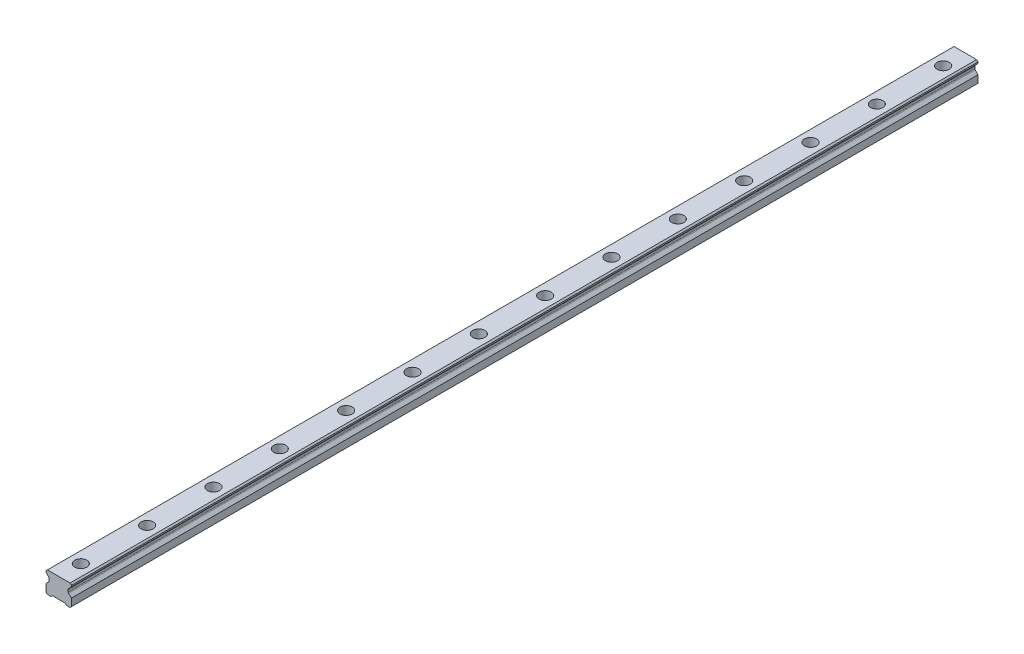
ISO-10303-21;
HEADER;
FILE_DESCRIPTION(('STEP AP214'),'2;1');
FILE_NAME('part.step','',(''),(''),'','','');
FILE_SCHEMA(('AUTOMOTIVE_DESIGN { 1 0 10303 214 1 1 1 1 }'));
ENDSEC;
DATA;
#1=APPLICATION_CONTEXT('core data for automotive mechanical design processes');
#2=APPLICATION_PROTOCOL_DEFINITION('international standard','automotive_design',2000,#1);
#3=PRODUCT_CONTEXT('',#1,'mechanical');
#4=PRODUCT('Part','Part','',(#3));
#5=PRODUCT_RELATED_PRODUCT_CATEGORY('part','',(#4));
#6=PRODUCT_DEFINITION_FORMATION('','',#4);
#7=PRODUCT_DEFINITION_CONTEXT('part definition',#1,'design');
#8=PRODUCT_DEFINITION('design','',#6,#7);
#9=PRODUCT_DEFINITION_SHAPE('','',#8);
#10=(LENGTH_UNIT() NAMED_UNIT(*) SI_UNIT(.MILLI.,.METRE.));
#11=(NAMED_UNIT(*) PLANE_ANGLE_UNIT() SI_UNIT($,.RADIAN.));
#12=(NAMED_UNIT(*) SI_UNIT($,.STERADIAN.) SOLID_ANGLE_UNIT());
#13=UNCERTAINTY_MEASURE_WITH_UNIT(LENGTH_MEASURE(1.E-05),#10,'distance_accuracy_value','');
#14=(GEOMETRIC_REPRESENTATION_CONTEXT(3) GLOBAL_UNCERTAINTY_ASSIGNED_CONTEXT((#13)) GLOBAL_UNIT_ASSIGNED_CONTEXT((#10,
#11,#12)) REPRESENTATION_CONTEXT('',''));
#15=CARTESIAN_POINT('',(0.,0.,0.));
#16=DIRECTION('',(0.,0.,1.));
#17=DIRECTION('',(1.,0.,0.));
#18=AXIS2_PLACEMENT_3D('',#15,#16,#17);
#19=CARTESIAN_POINT('',(0.,10.2,-390.));
#20=DIRECTION('',(0.,1.,0.));
#21=DIRECTION('',(0.,0.,1.));
#22=AXIS2_PLACEMENT_3D('',#19,#20,#21);
#23=PLANE('',#22);
#24=CARTESIAN_POINT('',(0.,10.2,-390.));
#25=DIRECTION('',(0.,1.,0.));
#26=DIRECTION('',(0.,0.,1.));
#27=AXIS2_PLACEMENT_3D('',#24,#25,#26);
#28=CIRCLE('',#27,3.5);
#29=CARTESIAN_POINT('',(0.,10.2,-386.5));
#30=VERTEX_POINT('',#29);
#31=EDGE_CURVE('E455',#30,#30,#28,.T.);
#32=ORIENTED_EDGE('',*,*,#31,.F.);
#33=EDGE_LOOP('',(#32));
#34=FACE_BOUND('',#33,.T.);
#35=CARTESIAN_POINT('',(0.,10.2,-390.));
#36=DIRECTION('',(0.,1.,0.));
#37=DIRECTION('',(0.,0.,1.));
#38=AXIS2_PLACEMENT_3D('',#35,#36,#37);
#39=CIRCLE('',#38,5.5);
#40=CARTESIAN_POINT('',(0.,10.2,-384.5));
#41=VERTEX_POINT('',#40);
#42=EDGE_CURVE('E11',#41,#41,#39,.T.);
#43=ORIENTED_EDGE('',*,*,#42,.T.);
#44=EDGE_LOOP('',(#43));
#45=FACE_BOUND('',#44,.T.);
#46=ADVANCED_FACE('F39',(#34,#45),#23,.T.);
#47=CARTESIAN_POINT('',(0.,10.2,-390.));
#48=DIRECTION('',(0.,1.,0.));
#49=DIRECTION('',(0.,0.,1.));
#50=AXIS2_PLACEMENT_3D('',#47,#48,#49);
#51=CYLINDRICAL_SURFACE('',#50,5.5);
#52=ORIENTED_EDGE('',*,*,#42,.F.);
#53=EDGE_LOOP('',(#52));
#54=FACE_BOUND('',#53,.T.);
#55=CARTESIAN_POINT('',(0.,19.2,-390.));
#56=DIRECTION('',(0.,1.,0.));
#57=DIRECTION('',(0.,0.,1.));
#58=AXIS2_PLACEMENT_3D('',#55,#56,#57);
#59=CIRCLE('',#58,5.5);
#60=CARTESIAN_POINT('',(0.,19.2,-384.5));
#61=VERTEX_POINT('',#60);
#62=EDGE_CURVE('E48',#61,#61,#59,.T.);
#63=ORIENTED_EDGE('',*,*,#62,.T.);
#64=EDGE_LOOP('',(#63));
#65=FACE_BOUND('',#64,.T.);
#66=ADVANCED_FACE('F732',(#54,#65),#51,.F.);
#67=CARTESIAN_POINT('',(0.,10.2,-330.));
#68=DIRECTION('',(0.,1.,0.));
#69=DIRECTION('',(0.,0.,1.));
#70=AXIS2_PLACEMENT_3D('',#67,#68,#69);
#71=PLANE('',#70);
#72=CARTESIAN_POINT('',(0.,10.2,-330.));
#73=DIRECTION('',(0.,1.,0.));
#74=DIRECTION('',(0.,0.,1.));
#75=AXIS2_PLACEMENT_3D('',#72,#73,#74);
#76=CIRCLE('',#75,3.5);
#77=CARTESIAN_POINT('',(0.,10.2,-326.5));
#78=VERTEX_POINT('',#77);
#79=EDGE_CURVE('E460',#78,#78,#76,.T.);
#80=ORIENTED_EDGE('',*,*,#79,.F.);
#81=EDGE_LOOP('',(#80));
#82=FACE_BOUND('',#81,.T.);
#83=CARTESIAN_POINT('',(0.,10.2,-330.));
#84=DIRECTION('',(0.,1.,0.));
#85=DIRECTION('',(0.,0.,1.));
#86=AXIS2_PLACEMENT_3D('',#83,#84,#85);
#87=CIRCLE('',#86,5.5);
#88=CARTESIAN_POINT('',(0.,10.2,-324.5));
#89=VERTEX_POINT('',#88);
#90=EDGE_CURVE('E439',#89,#89,#87,.T.);
#91=ORIENTED_EDGE('',*,*,#90,.T.);
#92=EDGE_LOOP('',(#91));
#93=FACE_BOUND('',#92,.T.);
#94=ADVANCED_FACE('F734',(#82,#93),#71,.T.);
#95=CARTESIAN_POINT('',(0.,10.2,-330.));
#96=DIRECTION('',(0.,1.,0.));
#97=DIRECTION('',(0.,0.,1.));
#98=AXIS2_PLACEMENT_3D('',#95,#96,#97);
#99=CYLINDRICAL_SURFACE('',#98,5.5);
#100=ORIENTED_EDGE('',*,*,#90,.F.);
#101=EDGE_LOOP('',(#100));
#102=FACE_BOUND('',#101,.T.);
#103=CARTESIAN_POINT('',(0.,19.2,-330.));
#104=DIRECTION('',(0.,1.,0.));
#105=DIRECTION('',(0.,0.,1.));
#106=AXIS2_PLACEMENT_3D('',#103,#104,#105);
#107=CIRCLE('',#106,5.5);
#108=CARTESIAN_POINT('',(0.,19.2,-324.5));
#109=VERTEX_POINT('',#108);
#110=EDGE_CURVE('E435',#109,#109,#107,.T.);
#111=ORIENTED_EDGE('',*,*,#110,.T.);
#112=EDGE_LOOP('',(#111));
#113=FACE_BOUND('',#112,.T.);
#114=ADVANCED_FACE('F740',(#102,#113),#99,.F.);
#115=CARTESIAN_POINT('',(0.,10.2,-270.));
#116=DIRECTION('',(0.,1.,0.));
#117=DIRECTION('',(0.,0.,1.));
#118=AXIS2_PLACEMENT_3D('',#115,#116,#117);
#119=PLANE('',#118);
#120=CARTESIAN_POINT('',(0.,10.2,-270.));
#121=DIRECTION('',(0.,1.,0.));
#122=DIRECTION('',(0.,0.,1.));
#123=AXIS2_PLACEMENT_3D('',#120,#121,#122);
#124=CIRCLE('',#123,3.5);
#125=CARTESIAN_POINT('',(0.,10.2,-266.5));
#126=VERTEX_POINT('',#125);
#127=EDGE_CURVE('E465',#126,#126,#124,.T.);
#128=ORIENTED_EDGE('',*,*,#127,.F.);
#129=EDGE_LOOP('',(#128));
#130=FACE_BOUND('',#129,.T.);
#131=CARTESIAN_POINT('',(0.,10.2,-270.));
#132=DIRECTION('',(0.,1.,0.));
#133=DIRECTION('',(0.,0.,1.));
#134=AXIS2_PLACEMENT_3D('',#131,#132,#133);
#135=CIRCLE('',#134,5.5);
#136=CARTESIAN_POINT('',(0.,10.2,-264.5));
#137=VERTEX_POINT('',#136);
#138=EDGE_CURVE('E431',#137,#137,#135,.T.);
#139=ORIENTED_EDGE('',*,*,#138,.T.);
#140=EDGE_LOOP('',(#139));
#141=FACE_BOUND('',#140,.T.);
#142=ADVANCED_FACE('F748',(#130,#141),#119,.T.);
#143=CARTESIAN_POINT('',(0.,10.2,-270.));
#144=DIRECTION('',(0.,1.,0.));
#145=DIRECTION('',(0.,0.,1.));
#146=AXIS2_PLACEMENT_3D('',#143,#144,#145);
#147=CYLINDRICAL_SURFACE('',#146,5.5);
#148=ORIENTED_EDGE('',*,*,#138,.F.);
#149=EDGE_LOOP('',(#148));
#150=FACE_BOUND('',#149,.T.);
#151=CARTESIAN_POINT('',(0.,19.2,-270.));
#152=DIRECTION('',(0.,1.,0.));
#153=DIRECTION('',(0.,0.,1.));
#154=AXIS2_PLACEMENT_3D('',#151,#152,#153);
#155=CIRCLE('',#154,5.5);
#156=CARTESIAN_POINT('',(0.,19.2,-264.5));
#157=VERTEX_POINT('',#156);
#158=EDGE_CURVE('E427',#157,#157,#155,.T.);
#159=ORIENTED_EDGE('',*,*,#158,.T.);
#160=EDGE_LOOP('',(#159));
#161=FACE_BOUND('',#160,.T.);
#162=ADVANCED_FACE('F752',(#150,#161),#147,.F.);
#163=CARTESIAN_POINT('',(0.,10.2,-210.));
#164=DIRECTION('',(0.,1.,0.));
#165=DIRECTION('',(0.,0.,1.));
#166=AXIS2_PLACEMENT_3D('',#163,#164,#165);
#167=PLANE('',#166);
#168=CARTESIAN_POINT('',(0.,10.2,-210.));
#169=DIRECTION('',(0.,1.,0.));
#170=DIRECTION('',(0.,0.,1.));
#171=AXIS2_PLACEMENT_3D('',#168,#169,#170);
#172=CIRCLE('',#171,3.5);
#173=CARTESIAN_POINT('',(0.,10.2,-206.5));
#174=VERTEX_POINT('',#173);
#175=EDGE_CURVE('E470',#174,#174,#172,.T.);
#176=ORIENTED_EDGE('',*,*,#175,.F.);
#177=EDGE_LOOP('',(#176));
#178=FACE_BOUND('',#177,.T.);
#179=CARTESIAN_POINT('',(0.,10.2,-210.));
#180=DIRECTION('',(0.,1.,0.));
#181=DIRECTION('',(0.,0.,1.));
#182=AXIS2_PLACEMENT_3D('',#179,#180,#181);
#183=CIRCLE('',#182,5.5);
#184=CARTESIAN_POINT('',(0.,10.2,-204.5));
#185=VERTEX_POINT('',#184);
#186=EDGE_CURVE('E423',#185,#185,#183,.T.);
#187=ORIENTED_EDGE('',*,*,#186,.T.);
#188=EDGE_LOOP('',(#187));
#189=FACE_BOUND('',#188,.T.);
#190=ADVANCED_FACE('F756',(#178,#189),#167,.T.);
#191=CARTESIAN_POINT('',(0.,10.2,-210.));
#192=DIRECTION('',(0.,1.,0.));
#193=DIRECTION('',(0.,0.,1.));
#194=AXIS2_PLACEMENT_3D('',#191,#192,#193);
#195=CYLINDRICAL_SURFACE('',#194,5.5);
#196=ORIENTED_EDGE('',*,*,#186,.F.);
#197=EDGE_LOOP('',(#196));
#198=FACE_BOUND('',#197,.T.);
#199=CARTESIAN_POINT('',(0.,19.2,-210.));
#200=DIRECTION('',(0.,1.,0.));
#201=DIRECTION('',(0.,0.,1.));
#202=AXIS2_PLACEMENT_3D('',#199,#200,#201);
#203=CIRCLE('',#202,5.5);
#204=CARTESIAN_POINT('',(0.,19.2,-204.5));
#205=VERTEX_POINT('',#204);
#206=EDGE_CURVE('E419',#205,#205,#203,.T.);
#207=ORIENTED_EDGE('',*,*,#206,.T.);
#208=EDGE_LOOP('',(#207));
#209=FACE_BOUND('',#208,.T.);
#210=ADVANCED_FACE('F760',(#198,#209),#195,.F.);
#211=CARTESIAN_POINT('',(0.,10.2,-150.));
#212=DIRECTION('',(0.,1.,0.));
#213=DIRECTION('',(0.,0.,1.));
#214=AXIS2_PLACEMENT_3D('',#211,#212,#213);
#215=PLANE('',#214);
#216=CARTESIAN_POINT('',(0.,10.2,-150.));
#217=DIRECTION('',(0.,1.,0.));
#218=DIRECTION('',(0.,0.,1.));
#219=AXIS2_PLACEMENT_3D('',#216,#217,#218);
#220=CIRCLE('',#219,3.5);
#221=CARTESIAN_POINT('',(0.,10.2,-146.5));
#222=VERTEX_POINT('',#221);
#223=EDGE_CURVE('E475',#222,#222,#220,.T.);
#224=ORIENTED_EDGE('',*,*,#223,.F.);
#225=EDGE_LOOP('',(#224));
#226=FACE_BOUND('',#225,.T.);
#227=CARTESIAN_POINT('',(0.,10.2,-150.));
#228=DIRECTION('',(0.,1.,0.));
#229=DIRECTION('',(0.,0.,1.));
#230=AXIS2_PLACEMENT_3D('',#227,#228,#229);
#231=CIRCLE('',#230,5.5);
#232=CARTESIAN_POINT('',(0.,10.2,-144.5));
#233=VERTEX_POINT('',#232);
#234=EDGE_CURVE('E415',#233,#233,#231,.T.);
#235=ORIENTED_EDGE('',*,*,#234,.T.);
#236=EDGE_LOOP('',(#235));
#237=FACE_BOUND('',#236,.T.);
#238=ADVANCED_FACE('F764',(#226,#237),#215,.T.);
#239=CARTESIAN_POINT('',(0.,10.2,-150.));
#240=DIRECTION('',(0.,1.,0.));
#241=DIRECTION('',(0.,0.,1.));
#242=AXIS2_PLACEMENT_3D('',#239,#240,#241);
#243=CYLINDRICAL_SURFACE('',#242,5.5);
#244=ORIENTED_EDGE('',*,*,#234,.F.);
#245=EDGE_LOOP('',(#244));
#246=FACE_BOUND('',#245,.T.);
#247=CARTESIAN_POINT('',(0.,19.2,-150.));
#248=DIRECTION('',(0.,1.,0.));
#249=DIRECTION('',(0.,0.,1.));
#250=AXIS2_PLACEMENT_3D('',#247,#248,#249);
#251=CIRCLE('',#250,5.5);
#252=CARTESIAN_POINT('',(0.,19.2,-144.5));
#253=VERTEX_POINT('',#252);
#254=EDGE_CURVE('E411',#253,#253,#251,.T.);
#255=ORIENTED_EDGE('',*,*,#254,.T.);
#256=EDGE_LOOP('',(#255));
#257=FACE_BOUND('',#256,.T.);
#258=ADVANCED_FACE('F768',(#246,#257),#243,.F.);
#259=CARTESIAN_POINT('',(0.,10.2,-90.));
#260=DIRECTION('',(0.,1.,0.));
#261=DIRECTION('',(0.,0.,1.));
#262=AXIS2_PLACEMENT_3D('',#259,#260,#261);
#263=PLANE('',#262);
#264=CARTESIAN_POINT('',(0.,10.2,-90.));
#265=DIRECTION('',(0.,1.,0.));
#266=DIRECTION('',(0.,0.,1.));
#267=AXIS2_PLACEMENT_3D('',#264,#265,#266);
#268=CIRCLE('',#267,3.5);
#269=CARTESIAN_POINT('',(0.,10.2,-86.5));
#270=VERTEX_POINT('',#269);
#271=EDGE_CURVE('E480',#270,#270,#268,.T.);
#272=ORIENTED_EDGE('',*,*,#271,.F.);
#273=EDGE_LOOP('',(#272));
#274=FACE_BOUND('',#273,.T.);
#275=CARTESIAN_POINT('',(0.,10.2,-90.));
#276=DIRECTION('',(0.,1.,0.));
#277=DIRECTION('',(0.,0.,1.));
#278=AXIS2_PLACEMENT_3D('',#275,#276,#277);
#279=CIRCLE('',#278,5.5);
#280=CARTESIAN_POINT('',(0.,10.2,-84.5));
#281=VERTEX_POINT('',#280);
#282=EDGE_CURVE('E407',#281,#281,#279,.T.);
#283=ORIENTED_EDGE('',*,*,#282,.T.);
#284=EDGE_LOOP('',(#283));
#285=FACE_BOUND('',#284,.T.);
#286=ADVANCED_FACE('F772',(#274,#285),#263,.T.);
#287=CARTESIAN_POINT('',(0.,10.2,-90.));
#288=DIRECTION('',(0.,1.,0.));
#289=DIRECTION('',(0.,0.,1.));
#290=AXIS2_PLACEMENT_3D('',#287,#288,#289);
#291=CYLINDRICAL_SURFACE('',#290,5.5);
#292=ORIENTED_EDGE('',*,*,#282,.F.);
#293=EDGE_LOOP('',(#292));
#294=FACE_BOUND('',#293,.T.);
#295=CARTESIAN_POINT('',(0.,19.2,-90.));
#296=DIRECTION('',(0.,1.,0.));
#297=DIRECTION('',(0.,0.,1.));
#298=AXIS2_PLACEMENT_3D('',#295,#296,#297);
#299=CIRCLE('',#298,5.5);
#300=CARTESIAN_POINT('',(0.,19.2,-84.5));
#301=VERTEX_POINT('',#300);
#302=EDGE_CURVE('E403',#301,#301,#299,.T.);
#303=ORIENTED_EDGE('',*,*,#302,.T.);
#304=EDGE_LOOP('',(#303));
#305=FACE_BOUND('',#304,.T.);
#306=ADVANCED_FACE('F776',(#294,#305),#291,.F.);
#307=CARTESIAN_POINT('',(0.,10.2,-30.));
#308=DIRECTION('',(0.,1.,0.));
#309=DIRECTION('',(0.,0.,1.));
#310=AXIS2_PLACEMENT_3D('',#307,#308,#309);
#311=PLANE('',#310);
#312=CARTESIAN_POINT('',(0.,10.2,-30.));
#313=DIRECTION('',(0.,1.,0.));
#314=DIRECTION('',(0.,0.,1.));
#315=AXIS2_PLACEMENT_3D('',#312,#313,#314);
#316=CIRCLE('',#315,3.5);
#317=CARTESIAN_POINT('',(0.,10.2,-26.5));
#318=VERTEX_POINT('',#317);
#319=EDGE_CURVE('E485',#318,#318,#316,.T.);
#320=ORIENTED_EDGE('',*,*,#319,.F.);
#321=EDGE_LOOP('',(#320));
#322=FACE_BOUND('',#321,.T.);
#323=CARTESIAN_POINT('',(0.,10.2,-30.));
#324=DIRECTION('',(0.,1.,0.));
#325=DIRECTION('',(0.,0.,1.));
#326=AXIS2_PLACEMENT_3D('',#323,#324,#325);
#327=CIRCLE('',#326,5.5);
#328=CARTESIAN_POINT('',(0.,10.2,-24.5));
#329=VERTEX_POINT('',#328);
#330=EDGE_CURVE('E399',#329,#329,#327,.T.);
#331=ORIENTED_EDGE('',*,*,#330,.T.);
#332=EDGE_LOOP('',(#331));
#333=FACE_BOUND('',#332,.T.);
#334=ADVANCED_FACE('F780',(#322,#333),#311,.T.);
#335=CARTESIAN_POINT('',(0.,10.2,-30.));
#336=DIRECTION('',(0.,1.,0.));
#337=DIRECTION('',(0.,0.,1.));
#338=AXIS2_PLACEMENT_3D('',#335,#336,#337);
#339=CYLINDRICAL_SURFACE('',#338,5.5);
#340=ORIENTED_EDGE('',*,*,#330,.F.);
#341=EDGE_LOOP('',(#340));
#342=FACE_BOUND('',#341,.T.);
#343=CARTESIAN_POINT('',(0.,19.2,-30.));
#344=DIRECTION('',(0.,1.,0.));
#345=DIRECTION('',(0.,0.,1.));
#346=AXIS2_PLACEMENT_3D('',#343,#344,#345);
#347=CIRCLE('',#346,5.5);
#348=CARTESIAN_POINT('',(0.,19.2,-24.5));
#349=VERTEX_POINT('',#348);
#350=EDGE_CURVE('E395',#349,#349,#347,.T.);
#351=ORIENTED_EDGE('',*,*,#350,.T.);
#352=EDGE_LOOP('',(#351));
#353=FACE_BOUND('',#352,.T.);
#354=ADVANCED_FACE('F702',(#342,#353),#339,.F.);
#355=CARTESIAN_POINT('',(0.,10.2,30.));
#356=DIRECTION('',(0.,1.,0.));
#357=DIRECTION('',(0.,0.,1.));
#358=AXIS2_PLACEMENT_3D('',#355,#356,#357);
#359=PLANE('',#358);
#360=CARTESIAN_POINT('',(0.,10.2,30.));
#361=DIRECTION('',(0.,1.,0.));
#362=DIRECTION('',(0.,0.,1.));
#363=AXIS2_PLACEMENT_3D('',#360,#361,#362);
#364=CIRCLE('',#363,3.5);
#365=CARTESIAN_POINT('',(0.,10.2,33.5));
#366=VERTEX_POINT('',#365);
#367=EDGE_CURVE('E490',#366,#366,#364,.T.);
#368=ORIENTED_EDGE('',*,*,#367,.F.);
#369=EDGE_LOOP('',(#368));
#370=FACE_BOUND('',#369,.T.);
#371=CARTESIAN_POINT('',(0.,10.2,30.));
#372=DIRECTION('',(0.,1.,0.));
#373=DIRECTION('',(0.,0.,1.));
#374=AXIS2_PLACEMENT_3D('',#371,#372,#373);
#375=CIRCLE('',#374,5.5);
#376=CARTESIAN_POINT('',(0.,10.2,35.5));
#377=VERTEX_POINT('',#376);
#378=EDGE_CURVE('E391',#377,#377,#375,.T.);
#379=ORIENTED_EDGE('',*,*,#378,.T.);
#380=EDGE_LOOP('',(#379));
#381=FACE_BOUND('',#380,.T.);
#382=ADVANCED_FACE('F698',(#370,#381),#359,.T.);
#383=CARTESIAN_POINT('',(0.,10.2,30.));
#384=DIRECTION('',(0.,1.,0.));
#385=DIRECTION('',(0.,0.,1.));
#386=AXIS2_PLACEMENT_3D('',#383,#384,#385);
#387=CYLINDRICAL_SURFACE('',#386,5.5);
#388=ORIENTED_EDGE('',*,*,#378,.F.);
#389=EDGE_LOOP('',(#388));
#390=FACE_BOUND('',#389,.T.);
#391=CARTESIAN_POINT('',(0.,19.2,30.));
#392=DIRECTION('',(0.,1.,0.));
#393=DIRECTION('',(0.,0.,1.));
#394=AXIS2_PLACEMENT_3D('',#391,#392,#393);
#395=CIRCLE('',#394,5.5);
#396=CARTESIAN_POINT('',(0.,19.2,35.5));
#397=VERTEX_POINT('',#396);
#398=EDGE_CURVE('E387',#397,#397,#395,.T.);
#399=ORIENTED_EDGE('',*,*,#398,.T.);
#400=EDGE_LOOP('',(#399));
#401=FACE_BOUND('',#400,.T.);
#402=ADVANCED_FACE('F701',(#390,#401),#387,.F.);
#403=CARTESIAN_POINT('',(0.,10.2,90.));
#404=DIRECTION('',(0.,1.,0.));
#405=DIRECTION('',(0.,0.,1.));
#406=AXIS2_PLACEMENT_3D('',#403,#404,#405);
#407=PLANE('',#406);
#408=CARTESIAN_POINT('',(0.,10.2,90.));
#409=DIRECTION('',(0.,1.,0.));
#410=DIRECTION('',(0.,0.,1.));
#411=AXIS2_PLACEMENT_3D('',#408,#409,#410);
#412=CIRCLE('',#411,3.5);
#413=CARTESIAN_POINT('',(0.,10.2,93.5));
#414=VERTEX_POINT('',#413);
#415=EDGE_CURVE('E495',#414,#414,#412,.T.);
#416=ORIENTED_EDGE('',*,*,#415,.F.);
#417=EDGE_LOOP('',(#416));
#418=FACE_BOUND('',#417,.T.);
#419=CARTESIAN_POINT('',(0.,10.2,90.));
#420=DIRECTION('',(0.,1.,0.));
#421=DIRECTION('',(0.,0.,1.));
#422=AXIS2_PLACEMENT_3D('',#419,#420,#421);
#423=CIRCLE('',#422,5.5);
#424=CARTESIAN_POINT('',(0.,10.2,95.5));
#425=VERTEX_POINT('',#424);
#426=EDGE_CURVE('E383',#425,#425,#423,.T.);
#427=ORIENTED_EDGE('',*,*,#426,.T.);
#428=EDGE_LOOP('',(#427));
#429=FACE_BOUND('',#428,.T.);
#430=ADVANCED_FACE('F708',(#418,#429),#407,.T.);
#431=CARTESIAN_POINT('',(0.,10.2,90.));
#432=DIRECTION('',(0.,1.,0.));
#433=DIRECTION('',(0.,0.,1.));
#434=AXIS2_PLACEMENT_3D('',#431,#432,#433);
#435=CYLINDRICAL_SURFACE('',#434,5.5);
#436=ORIENTED_EDGE('',*,*,#426,.F.);
#437=EDGE_LOOP('',(#436));
#438=FACE_BOUND('',#437,.T.);
#439=CARTESIAN_POINT('',(0.,19.2,90.));
#440=DIRECTION('',(0.,1.,0.));
#441=DIRECTION('',(0.,0.,1.));
#442=AXIS2_PLACEMENT_3D('',#439,#440,#441);
#443=CIRCLE('',#442,5.5);
#444=CARTESIAN_POINT('',(0.,19.2,95.5));
#445=VERTEX_POINT('',#444);
#446=EDGE_CURVE('E379',#445,#445,#443,.T.);
#447=ORIENTED_EDGE('',*,*,#446,.T.);
#448=EDGE_LOOP('',(#447));
#449=FACE_BOUND('',#448,.T.);
#450=ADVANCED_FACE('F790',(#438,#449),#435,.F.);
#451=CARTESIAN_POINT('',(0.,10.2,150.));
#452=DIRECTION('',(0.,1.,0.));
#453=DIRECTION('',(0.,0.,1.));
#454=AXIS2_PLACEMENT_3D('',#451,#452,#453);
#455=PLANE('',#454);
#456=CARTESIAN_POINT('',(0.,10.2,150.));
#457=DIRECTION('',(0.,1.,0.));
#458=DIRECTION('',(0.,0.,1.));
#459=AXIS2_PLACEMENT_3D('',#456,#457,#458);
#460=CIRCLE('',#459,3.5);
#461=CARTESIAN_POINT('',(0.,10.2,153.5));
#462=VERTEX_POINT('',#461);
#463=EDGE_CURVE('E499',#462,#462,#460,.T.);
#464=ORIENTED_EDGE('',*,*,#463,.F.);
#465=EDGE_LOOP('',(#464));
#466=FACE_BOUND('',#465,.T.);
#467=CARTESIAN_POINT('',(0.,10.2,150.));
#468=DIRECTION('',(0.,1.,0.));
#469=DIRECTION('',(0.,0.,1.));
#470=AXIS2_PLACEMENT_3D('',#467,#468,#469);
#471=CIRCLE('',#470,5.5);
#472=CARTESIAN_POINT('',(0.,10.2,155.5));
#473=VERTEX_POINT('',#472);
#474=EDGE_CURVE('E375',#473,#473,#471,.T.);
#475=ORIENTED_EDGE('',*,*,#474,.T.);
#476=EDGE_LOOP('',(#475));
#477=FACE_BOUND('',#476,.T.);
#478=ADVANCED_FACE('F794',(#466,#477),#455,.T.);
#479=CARTESIAN_POINT('',(0.,10.2,150.));
#480=DIRECTION('',(0.,1.,0.));
#481=DIRECTION('',(0.,0.,1.));
#482=AXIS2_PLACEMENT_3D('',#479,#480,#481);
#483=CYLINDRICAL_SURFACE('',#482,5.5);
#484=ORIENTED_EDGE('',*,*,#474,.F.);
#485=EDGE_LOOP('',(#484));
#486=FACE_BOUND('',#485,.T.);
#487=CARTESIAN_POINT('',(0.,19.2,150.));
#488=DIRECTION('',(0.,1.,0.));
#489=DIRECTION('',(0.,0.,1.));
#490=AXIS2_PLACEMENT_3D('',#487,#488,#489);
#491=CIRCLE('',#490,5.5);
#492=CARTESIAN_POINT('',(0.,19.2,155.5));
#493=VERTEX_POINT('',#492);
#494=EDGE_CURVE('E371',#493,#493,#491,.T.);
#495=ORIENTED_EDGE('',*,*,#494,.T.);
#496=EDGE_LOOP('',(#495));
#497=FACE_BOUND('',#496,.T.);
#498=ADVANCED_FACE('F798',(#486,#497),#483,.F.);
#499=CARTESIAN_POINT('',(0.,10.2,210.));
#500=DIRECTION('',(0.,1.,0.));
#501=DIRECTION('',(0.,0.,1.));
#502=AXIS2_PLACEMENT_3D('',#499,#500,#501);
#503=PLANE('',#502);
#504=CARTESIAN_POINT('',(0.,10.2,210.));
#505=DIRECTION('',(0.,1.,0.));
#506=DIRECTION('',(0.,0.,1.));
#507=AXIS2_PLACEMENT_3D('',#504,#505,#506);
#508=CIRCLE('',#507,3.5);
#509=CARTESIAN_POINT('',(0.,10.2,213.5));
#510=VERTEX_POINT('',#509);
#511=EDGE_CURVE('E503',#510,#510,#508,.T.);
#512=ORIENTED_EDGE('',*,*,#511,.F.);
#513=EDGE_LOOP('',(#512));
#514=FACE_BOUND('',#513,.T.);
#515=CARTESIAN_POINT('',(0.,10.2,210.));
#516=DIRECTION('',(0.,1.,0.));
#517=DIRECTION('',(0.,0.,1.));
#518=AXIS2_PLACEMENT_3D('',#515,#516,#517);
#519=CIRCLE('',#518,5.5);
#520=CARTESIAN_POINT('',(0.,10.2,215.5));
#521=VERTEX_POINT('',#520);
#522=EDGE_CURVE('E367',#521,#521,#519,.T.);
#523=ORIENTED_EDGE('',*,*,#522,.T.);
#524=EDGE_LOOP('',(#523));
#525=FACE_BOUND('',#524,.T.);
#526=ADVANCED_FACE('F802',(#514,#525),#503,.T.);
#527=CARTESIAN_POINT('',(0.,10.2,210.));
#528=DIRECTION('',(0.,1.,0.));
#529=DIRECTION('',(0.,0.,1.));
#530=AXIS2_PLACEMENT_3D('',#527,#528,#529);
#531=CYLINDRICAL_SURFACE('',#530,5.5);
#532=ORIENTED_EDGE('',*,*,#522,.F.);
#533=EDGE_LOOP('',(#532));
#534=FACE_BOUND('',#533,.T.);
#535=CARTESIAN_POINT('',(0.,19.2,210.));
#536=DIRECTION('',(0.,1.,0.));
#537=DIRECTION('',(0.,0.,1.));
#538=AXIS2_PLACEMENT_3D('',#535,#536,#537);
#539=CIRCLE('',#538,5.5);
#540=CARTESIAN_POINT('',(0.,19.2,215.5));
#541=VERTEX_POINT('',#540);
#542=EDGE_CURVE('E363',#541,#541,#539,.T.);
#543=ORIENTED_EDGE('',*,*,#542,.T.);
#544=EDGE_LOOP('',(#543));
#545=FACE_BOUND('',#544,.T.);
#546=ADVANCED_FACE('F806',(#534,#545),#531,.F.);
#547=CARTESIAN_POINT('',(0.,10.2,270.));
#548=DIRECTION('',(0.,1.,0.));
#549=DIRECTION('',(0.,0.,1.));
#550=AXIS2_PLACEMENT_3D('',#547,#548,#549);
#551=PLANE('',#550);
#552=CARTESIAN_POINT('',(0.,10.2,270.));
#553=DIRECTION('',(0.,1.,0.));
#554=DIRECTION('',(0.,0.,1.));
#555=AXIS2_PLACEMENT_3D('',#552,#553,#554);
#556=CIRCLE('',#555,3.5);
#557=CARTESIAN_POINT('',(0.,10.2,273.5));
#558=VERTEX_POINT('',#557);
#559=EDGE_CURVE('E516',#558,#558,#556,.T.);
#560=ORIENTED_EDGE('',*,*,#559,.F.);
#561=EDGE_LOOP('',(#560));
#562=FACE_BOUND('',#561,.T.);
#563=CARTESIAN_POINT('',(0.,10.2,270.));
#564=DIRECTION('',(0.,1.,0.));
#565=DIRECTION('',(0.,0.,1.));
#566=AXIS2_PLACEMENT_3D('',#563,#564,#565);
#567=CIRCLE('',#566,5.5);
#568=CARTESIAN_POINT('',(0.,10.2,275.5));
#569=VERTEX_POINT('',#568);
#570=EDGE_CURVE('E359',#569,#569,#567,.T.);
#571=ORIENTED_EDGE('',*,*,#570,.T.);
#572=EDGE_LOOP('',(#571));
#573=FACE_BOUND('',#572,.T.);
#574=ADVANCED_FACE('F810',(#562,#573),#551,.T.);
#575=CARTESIAN_POINT('',(0.,10.2,270.));
#576=DIRECTION('',(0.,1.,0.));
#577=DIRECTION('',(0.,0.,1.));
#578=AXIS2_PLACEMENT_3D('',#575,#576,#577);
#579=CYLINDRICAL_SURFACE('',#578,5.5);
#580=ORIENTED_EDGE('',*,*,#570,.F.);
#581=EDGE_LOOP('',(#580));
#582=FACE_BOUND('',#581,.T.);
#583=CARTESIAN_POINT('',(0.,19.2,270.));
#584=DIRECTION('',(0.,1.,0.));
#585=DIRECTION('',(0.,0.,1.));
#586=AXIS2_PLACEMENT_3D('',#583,#584,#585);
#587=CIRCLE('',#586,5.5);
#588=CARTESIAN_POINT('',(0.,19.2,275.5));
#589=VERTEX_POINT('',#588);
#590=EDGE_CURVE('E355',#589,#589,#587,.T.);
#591=ORIENTED_EDGE('',*,*,#590,.T.);
#592=EDGE_LOOP('',(#591));
#593=FACE_BOUND('',#592,.T.);
#594=ADVANCED_FACE('F814',(#582,#593),#579,.F.);
#595=CARTESIAN_POINT('',(11.5,0.,410.));
#596=DIRECTION('',(0.,1.,0.));
#597=DIRECTION('',(-1.,0.,0.));
#598=AXIS2_PLACEMENT_3D('',#595,#596,#597);
#599=PLANE('',#598);
#600=DIRECTION('',(1.,0.,0.));
#601=VECTOR('',#600,1.);
#602=CARTESIAN_POINT('',(11.5,0.,-410.));
#603=LINE('',#602,#601);
#604=CARTESIAN_POINT('',(-10.2499999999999,0.,-410.));
#605=VERTEX_POINT('',#604);
#606=CARTESIAN_POINT('',(-7.,0.,-410.));
#607=VERTEX_POINT('',#606);
#608=EDGE_CURVE('E229',#605,#607,#603,.T.);
#609=ORIENTED_EDGE('',*,*,#608,.T.);
#610=DIRECTION('',(0.,0.,1.));
#611=VECTOR('',#610,1.);
#612=CARTESIAN_POINT('',(-7.,0.,-410.));
#613=LINE('',#612,#611);
#614=CARTESIAN_POINT('',(-7.,0.,410.));
#615=VERTEX_POINT('',#614);
#616=EDGE_CURVE('E556',#607,#615,#613,.T.);
#617=ORIENTED_EDGE('',*,*,#616,.T.);
#618=DIRECTION('',(1.,0.,0.));
#619=VECTOR('',#618,1.);
#620=CARTESIAN_POINT('',(11.5,0.,410.));
#621=LINE('',#620,#619);
#622=CARTESIAN_POINT('',(-10.2499999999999,0.,410.));
#623=VERTEX_POINT('',#622);
#624=EDGE_CURVE('E626',#623,#615,#621,.T.);
#625=ORIENTED_EDGE('',*,*,#624,.F.);
#626=DIRECTION('',(0.,0.,-1.));
#627=VECTOR('',#626,1.);
#628=CARTESIAN_POINT('',(-10.2499999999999,0.,410.));
#629=LINE('',#628,#627);
#630=EDGE_CURVE('E290',#623,#605,#629,.T.);
#631=ORIENTED_EDGE('',*,*,#630,.T.);
#632=EDGE_LOOP('',(#609,#617,#625,#631));
#633=FACE_BOUND('',#632,.T.);
#634=ADVANCED_FACE('F818',(#633),#599,.F.);
#635=CARTESIAN_POINT('',(-11.5,19.2,410.));
#636=DIRECTION('',(1.,0.,0.));
#637=DIRECTION('',(0.,1.,0.));
#638=AXIS2_PLACEMENT_3D('',#635,#636,#637);
#639=PLANE('',#638);
#640=DIRECTION('',(0.,-1.,0.));
#641=VECTOR('',#640,1.);
#642=CARTESIAN_POINT('',(-11.5,19.2,410.));
#643=LINE('',#642,#641);
#644=CARTESIAN_POINT('',(-11.5,17.9500000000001,410.));
#645=VERTEX_POINT('',#644);
#646=CARTESIAN_POINT('',(-11.5,16.7,410.));
#647=VERTEX_POINT('',#646);
#648=EDGE_CURVE('E622',#645,#647,#643,.T.);
#649=ORIENTED_EDGE('',*,*,#648,.F.);
#650=DIRECTION('',(0.,0.,-1.));
#651=VECTOR('',#650,1.);
#652=CARTESIAN_POINT('',(-11.5,17.9500000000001,410.));
#653=LINE('',#652,#651);
#654=CARTESIAN_POINT('',(-11.5,17.9500000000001,-410.));
#655=VERTEX_POINT('',#654);
#656=EDGE_CURVE('E252',#645,#655,#653,.T.);
#657=ORIENTED_EDGE('',*,*,#656,.T.);
#658=DIRECTION('',(0.,-1.,0.));
#659=VECTOR('',#658,1.);
#660=CARTESIAN_POINT('',(-11.5,19.2,-410.));
#661=LINE('',#660,#659);
#662=CARTESIAN_POINT('',(-11.5,16.7,-410.));
#663=VERTEX_POINT('',#662);
#664=EDGE_CURVE('E230',#655,#663,#661,.T.);
#665=ORIENTED_EDGE('',*,*,#664,.T.);
#666=DIRECTION('',(0.,0.,1.));
#667=VECTOR('',#666,1.);
#668=CARTESIAN_POINT('',(-11.5,16.7,-410.));
#669=LINE('',#668,#667);
#670=EDGE_CURVE('E577',#663,#647,#669,.T.);
#671=ORIENTED_EDGE('',*,*,#670,.T.);
#672=EDGE_LOOP('',(#649,#657,#665,#671));
#673=FACE_BOUND('',#672,.T.);
#674=ADVANCED_FACE('F651',(#673),#639,.F.);
#675=CARTESIAN_POINT('',(11.5,19.2,410.));
#676=DIRECTION('',(-1.,0.,0.));
#677=DIRECTION('',(0.,0.,1.));
#678=AXIS2_PLACEMENT_3D('',#675,#676,#677);
#679=PLANE('',#678);
#680=DIRECTION('',(0.,1.,0.));
#681=VECTOR('',#680,1.);
#682=CARTESIAN_POINT('',(11.5,19.2,410.));
#683=LINE('',#682,#681);
#684=CARTESIAN_POINT('',(11.5,1.25000000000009,410.));
#685=VERTEX_POINT('',#684);
#686=CARTESIAN_POINT('',(11.5,7.95,410.));
#687=VERTEX_POINT('',#686);
#688=EDGE_CURVE('E631',#685,#687,#683,.T.);
#689=ORIENTED_EDGE('',*,*,#688,.F.);
#690=DIRECTION('',(0.,0.,-1.));
#691=VECTOR('',#690,1.);
#692=CARTESIAN_POINT('',(11.5,1.25000000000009,410.));
#693=LINE('',#692,#691);
#694=CARTESIAN_POINT('',(11.5,1.25000000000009,-410.));
#695=VERTEX_POINT('',#694);
#696=EDGE_CURVE('E297',#685,#695,#693,.T.);
#697=ORIENTED_EDGE('',*,*,#696,.T.);
#698=DIRECTION('',(0.,1.,0.));
#699=VECTOR('',#698,1.);
#700=CARTESIAN_POINT('',(11.5,19.2,-410.));
#701=LINE('',#700,#699);
#702=CARTESIAN_POINT('',(11.5,7.95,-410.));
#703=VERTEX_POINT('',#702);
#704=EDGE_CURVE('E243',#695,#703,#701,.T.);
#705=ORIENTED_EDGE('',*,*,#704,.T.);
#706=DIRECTION('',(0.,0.,1.));
#707=VECTOR('',#706,1.);
#708=CARTESIAN_POINT('',(11.5,7.95,-410.));
#709=LINE('',#708,#707);
#710=EDGE_CURVE('E607',#703,#687,#709,.T.);
#711=ORIENTED_EDGE('',*,*,#710,.T.);
#712=EDGE_LOOP('',(#689,#697,#705,#711));
#713=FACE_BOUND('',#712,.T.);
#714=ADVANCED_FACE('F849',(#713),#679,.F.);
#715=CARTESIAN_POINT('',(-11.5,7.95,-410.));
#716=VERTEX_POINT('',#715);
#717=CARTESIAN_POINT('',(-11.5,1.24999999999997,-410.));
#718=VERTEX_POINT('',#717);
#719=EDGE_CURVE('E239',#716,#718,#661,.T.);
#720=ORIENTED_EDGE('',*,*,#719,.T.);
#721=DIRECTION('',(0.,0.,1.));
#722=VECTOR('',#721,1.);
#723=CARTESIAN_POINT('',(-11.5,1.24999999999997,410.));
#724=LINE('',#723,#722);
#725=CARTESIAN_POINT('',(-11.5,1.24999999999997,410.));
#726=VERTEX_POINT('',#725);
#727=EDGE_CURVE('E294',#718,#726,#724,.T.);
#728=ORIENTED_EDGE('',*,*,#727,.T.);
#729=CARTESIAN_POINT('',(-11.5,7.95,410.));
#730=VERTEX_POINT('',#729);
#731=EDGE_CURVE('E251',#730,#726,#643,.T.);
#732=ORIENTED_EDGE('',*,*,#731,.F.);
#733=DIRECTION('',(0.,0.,1.));
#734=VECTOR('',#733,1.);
#735=CARTESIAN_POINT('',(-11.5,7.95,-410.));
#736=LINE('',#735,#734);
#737=EDGE_CURVE('E589',#716,#730,#736,.T.);
#738=ORIENTED_EDGE('',*,*,#737,.F.);
#739=EDGE_LOOP('',(#720,#728,#732,#738));
#740=FACE_BOUND('',#739,.T.);
#741=ADVANCED_FACE('F679',(#740),#639,.F.);
#742=CARTESIAN_POINT('',(7.,0.,410.));
#743=VERTEX_POINT('',#742);
#744=CARTESIAN_POINT('',(10.2499999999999,0.,410.));
#745=VERTEX_POINT('',#744);
#746=EDGE_CURVE('E219',#743,#745,#621,.T.);
#747=ORIENTED_EDGE('',*,*,#746,.F.);
#748=DIRECTION('',(0.,0.,1.));
#749=VECTOR('',#748,1.);
#750=CARTESIAN_POINT('',(7.,0.,-410.));
#751=LINE('',#750,#749);
#752=CARTESIAN_POINT('',(7.,0.,-410.));
#753=VERTEX_POINT('',#752);
#754=EDGE_CURVE('E206',#753,#743,#751,.T.);
#755=ORIENTED_EDGE('',*,*,#754,.F.);
#756=CARTESIAN_POINT('',(10.2499999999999,0.,-410.));
#757=VERTEX_POINT('',#756);
#758=EDGE_CURVE('E217',#753,#757,#603,.T.);
#759=ORIENTED_EDGE('',*,*,#758,.T.);
#760=DIRECTION('',(0.,0.,1.));
#761=VECTOR('',#760,1.);
#762=CARTESIAN_POINT('',(10.2499999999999,0.,410.));
#763=LINE('',#762,#761);
#764=EDGE_CURVE('E287',#757,#745,#763,.T.);
#765=ORIENTED_EDGE('',*,*,#764,.T.);
#766=EDGE_LOOP('',(#747,#755,#759,#765));
#767=FACE_BOUND('',#766,.T.);
#768=ADVANCED_FACE('F215',(#767),#599,.F.);
#769=CARTESIAN_POINT('',(11.5,16.7,-410.));
#770=VERTEX_POINT('',#769);
#771=CARTESIAN_POINT('',(11.5,17.95,-410.));
#772=VERTEX_POINT('',#771);
#773=EDGE_CURVE('E236',#770,#772,#701,.T.);
#774=ORIENTED_EDGE('',*,*,#773,.T.);
#775=DIRECTION('',(0.,0.,1.));
#776=VECTOR('',#775,1.);
#777=CARTESIAN_POINT('',(11.5,17.95,410.));
#778=LINE('',#777,#776);
#779=CARTESIAN_POINT('',(11.5,17.95,410.));
#780=VERTEX_POINT('',#779);
#781=EDGE_CURVE('E301',#772,#780,#778,.T.);
#782=ORIENTED_EDGE('',*,*,#781,.T.);
#783=CARTESIAN_POINT('',(11.5,16.7,410.));
#784=VERTEX_POINT('',#783);
#785=EDGE_CURVE('E630',#784,#780,#683,.T.);
#786=ORIENTED_EDGE('',*,*,#785,.F.);
#787=DIRECTION('',(0.,0.,1.));
#788=VECTOR('',#787,1.);
#789=CARTESIAN_POINT('',(11.5,16.7,-410.));
#790=LINE('',#789,#788);
#791=EDGE_CURVE('E582',#770,#784,#790,.T.);
#792=ORIENTED_EDGE('',*,*,#791,.F.);
#793=EDGE_LOOP('',(#774,#782,#786,#792));
#794=FACE_BOUND('',#793,.T.);
#795=ADVANCED_FACE('F715',(#794),#679,.F.);
#796=CARTESIAN_POINT('',(11.5,19.2,410.));
#797=DIRECTION('',(0.,-1.,0.));
#798=DIRECTION('',(0.,0.,-1.));
#799=AXIS2_PLACEMENT_3D('',#796,#797,#798);
#800=PLANE('',#799);
#801=CARTESIAN_POINT('',(0.,19.2,330.));
#802=DIRECTION('',(0.,1.,0.));
#803=DIRECTION('',(0.,0.,1.));
#804=AXIS2_PLACEMENT_3D('',#801,#802,#803);
#805=CIRCLE('',#804,5.5);
#806=CARTESIAN_POINT('',(0.,19.2,335.5));
#807=VERTEX_POINT('',#806);
#808=EDGE_CURVE('E520',#807,#807,#805,.T.);
#809=ORIENTED_EDGE('',*,*,#808,.F.);
#810=EDGE_LOOP('',(#809));
#811=FACE_BOUND('',#810,.T.);
#812=CARTESIAN_POINT('',(0.,19.2,390.));
#813=DIRECTION('',(0.,1.,0.));
#814=DIRECTION('',(0.,0.,1.));
#815=AXIS2_PLACEMENT_3D('',#812,#813,#814);
#816=CIRCLE('',#815,5.5);
#817=CARTESIAN_POINT('',(0.,19.2,395.5));
#818=VERTEX_POINT('',#817);
#819=EDGE_CURVE('E535',#818,#818,#816,.T.);
#820=ORIENTED_EDGE('',*,*,#819,.F.);
#821=EDGE_LOOP('',(#820));
#822=FACE_BOUND('',#821,.T.);
#823=DIRECTION('',(-1.,0.,0.));
#824=VECTOR('',#823,1.);
#825=CARTESIAN_POINT('',(11.5,19.2,-410.));
#826=LINE('',#825,#824);
#827=CARTESIAN_POINT('',(10.25,19.2,-410.));
#828=VERTEX_POINT('',#827);
#829=CARTESIAN_POINT('',(-10.2500000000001,19.2,-410.));
#830=VERTEX_POINT('',#829);
#831=EDGE_CURVE('E247',#828,#830,#826,.T.);
#832=ORIENTED_EDGE('',*,*,#831,.T.);
#833=DIRECTION('',(0.,0.,1.));
#834=VECTOR('',#833,1.);
#835=CARTESIAN_POINT('',(-10.2500000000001,19.2,410.));
#836=LINE('',#835,#834);
#837=CARTESIAN_POINT('',(-10.2500000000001,19.2,410.));
#838=VERTEX_POINT('',#837);
#839=EDGE_CURVE('E272',#830,#838,#836,.T.);
#840=ORIENTED_EDGE('',*,*,#839,.T.);
#841=DIRECTION('',(-1.,0.,0.));
#842=VECTOR('',#841,1.);
#843=CARTESIAN_POINT('',(11.5,19.2,410.));
#844=LINE('',#843,#842);
#845=CARTESIAN_POINT('',(10.25,19.2,410.));
#846=VERTEX_POINT('',#845);
#847=EDGE_CURVE('E257',#846,#838,#844,.T.);
#848=ORIENTED_EDGE('',*,*,#847,.F.);
#849=DIRECTION('',(0.,0.,-1.));
#850=VECTOR('',#849,1.);
#851=CARTESIAN_POINT('',(10.25,19.2,410.));
#852=LINE('',#851,#850);
#853=EDGE_CURVE('E268',#846,#828,#852,.T.);
#854=ORIENTED_EDGE('',*,*,#853,.T.);
#855=EDGE_LOOP('',(#832,#840,#848,#854));
#856=FACE_BOUND('',#855,.T.);
#857=ORIENTED_EDGE('',*,*,#590,.F.);
#858=EDGE_LOOP('',(#857));
#859=FACE_BOUND('',#858,.T.);
#860=ORIENTED_EDGE('',*,*,#542,.F.);
#861=EDGE_LOOP('',(#860));
#862=FACE_BOUND('',#861,.T.);
#863=ORIENTED_EDGE('',*,*,#494,.F.);
#864=EDGE_LOOP('',(#863));
#865=FACE_BOUND('',#864,.T.);
#866=ORIENTED_EDGE('',*,*,#446,.F.);
#867=EDGE_LOOP('',(#866));
#868=FACE_BOUND('',#867,.T.);
#869=ORIENTED_EDGE('',*,*,#398,.F.);
#870=EDGE_LOOP('',(#869));
#871=FACE_BOUND('',#870,.T.);
#872=ORIENTED_EDGE('',*,*,#350,.F.);
#873=EDGE_LOOP('',(#872));
#874=FACE_BOUND('',#873,.T.);
#875=ORIENTED_EDGE('',*,*,#302,.F.);
#876=EDGE_LOOP('',(#875));
#877=FACE_BOUND('',#876,.T.);
#878=ORIENTED_EDGE('',*,*,#254,.F.);
#879=EDGE_LOOP('',(#878));
#880=FACE_BOUND('',#879,.T.);
#881=ORIENTED_EDGE('',*,*,#206,.F.);
#882=EDGE_LOOP('',(#881));
#883=FACE_BOUND('',#882,.T.);
#884=ORIENTED_EDGE('',*,*,#158,.F.);
#885=EDGE_LOOP('',(#884));
#886=FACE_BOUND('',#885,.T.);
#887=ORIENTED_EDGE('',*,*,#110,.F.);
#888=EDGE_LOOP('',(#887));
#889=FACE_BOUND('',#888,.T.);
#890=ORIENTED_EDGE('',*,*,#62,.F.);
#891=EDGE_LOOP('',(#890));
#892=FACE_BOUND('',#891,.T.);
#893=ADVANCED_FACE('F712',(#811,#822,#856,#859,#862,#865,#868,#871,#874,#877,#880,#883,#886,
#889,#892),#800,.F.);
#894=CARTESIAN_POINT('',(0.,0.,410.));
#895=DIRECTION('',(0.,0.,-1.));
#896=DIRECTION('',(-1.,0.,0.));
#897=AXIS2_PLACEMENT_3D('',#894,#895,#896);
#898=PLANE('',#897);
#899=ORIENTED_EDGE('',*,*,#624,.T.);
#900=DIRECTION('',(-0.707106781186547,-0.707106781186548,0.));
#901=VECTOR('',#900,1.);
#902=CARTESIAN_POINT('',(-7.,0.,410.));
#903=LINE('',#902,#901);
#904=CARTESIAN_POINT('',(-5.75,1.25,410.));
#905=VERTEX_POINT('',#904);
#906=EDGE_CURVE('E211',#905,#615,#903,.T.);
#907=ORIENTED_EDGE('',*,*,#906,.F.);
#908=DIRECTION('',(-1.,0.,0.));
#909=VECTOR('',#908,1.);
#910=CARTESIAN_POINT('',(-5.75,1.25,410.));
#911=LINE('',#910,#909);
#912=CARTESIAN_POINT('',(5.75,1.25,410.));
#913=VERTEX_POINT('',#912);
#914=EDGE_CURVE('E550',#913,#905,#911,.T.);
#915=ORIENTED_EDGE('',*,*,#914,.F.);
#916=DIRECTION('',(-0.707106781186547,0.707106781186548,0.));
#917=VECTOR('',#916,1.);
#918=CARTESIAN_POINT('',(5.75,1.25,410.));
#919=LINE('',#918,#917);
#920=EDGE_CURVE('E540',#743,#913,#919,.T.);
#921=ORIENTED_EDGE('',*,*,#920,.F.);
#922=ORIENTED_EDGE('',*,*,#746,.T.);
#923=DIRECTION('',(-0.707106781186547,-0.707106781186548,0.));
#924=VECTOR('',#923,1.);
#925=CARTESIAN_POINT('',(11.5,1.25000000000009,410.));
#926=LINE('',#925,#924);
#927=EDGE_CURVE('E278',#745,#685,#926,.F.);
#928=ORIENTED_EDGE('',*,*,#927,.T.);
#929=ORIENTED_EDGE('',*,*,#688,.T.);
#930=DIRECTION('',(0.707106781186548,-0.707106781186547,0.));
#931=VECTOR('',#930,1.);
#932=CARTESIAN_POINT('',(11.5,7.95,410.));
#933=LINE('',#932,#931);
#934=CARTESIAN_POINT('',(8.94944985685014,10.5005501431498,410.));
#935=VERTEX_POINT('',#934);
#936=EDGE_CURVE('E560',#935,#687,#933,.T.);
#937=ORIENTED_EDGE('',*,*,#936,.F.);
#938=CARTESIAN_POINT('',(9.83333333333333,11.384433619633,410.));
#939=DIRECTION('',(0.,0.,-1.));
#940=DIRECTION('',(-1.,0.,0.));
#941=AXIS2_PLACEMENT_3D('',#938,#939,#940);
#942=CIRCLE('',#941,1.25);
#943=CARTESIAN_POINT('',(8.58333333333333,11.384433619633,410.));
#944=VERTEX_POINT('',#943);
#945=EDGE_CURVE('E332',#935,#944,#942,.T.);
#946=ORIENTED_EDGE('',*,*,#945,.T.);
#947=DIRECTION('',(0.,-1.,0.));
#948=VECTOR('',#947,1.);
#949=CARTESIAN_POINT('',(8.58333333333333,10.8666666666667,410.));
#950=LINE('',#949,#948);
#951=CARTESIAN_POINT('',(8.58333333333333,13.265566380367,410.));
#952=VERTEX_POINT('',#951);
#953=EDGE_CURVE('E599',#952,#944,#950,.T.);
#954=ORIENTED_EDGE('',*,*,#953,.F.);
#955=CARTESIAN_POINT('',(9.83333333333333,13.265566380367,410.));
#956=DIRECTION('',(0.,0.,-1.));
#957=DIRECTION('',(-1.,0.,0.));
#958=AXIS2_PLACEMENT_3D('',#955,#956,#957);
#959=CIRCLE('',#958,1.25);
#960=CARTESIAN_POINT('',(8.94944985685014,14.1494498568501,410.));
#961=VERTEX_POINT('',#960);
#962=EDGE_CURVE('E338',#952,#961,#959,.T.);
#963=ORIENTED_EDGE('',*,*,#962,.T.);
#964=DIRECTION('',(-0.707106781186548,-0.707106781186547,0.));
#965=VECTOR('',#964,1.);
#966=CARTESIAN_POINT('',(8.58333333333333,13.7833333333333,410.));
#967=LINE('',#966,#965);
#968=EDGE_CURVE('E610',#784,#961,#967,.T.);
#969=ORIENTED_EDGE('',*,*,#968,.F.);
#970=ORIENTED_EDGE('',*,*,#785,.T.);
#971=DIRECTION('',(0.707106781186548,-0.707106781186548,0.));
#972=VECTOR('',#971,1.);
#973=CARTESIAN_POINT('',(10.25,19.2,410.));
#974=LINE('',#973,#972);
#975=EDGE_CURVE('E275',#780,#846,#974,.F.);
#976=ORIENTED_EDGE('',*,*,#975,.T.);
#977=ORIENTED_EDGE('',*,*,#847,.T.);
#978=DIRECTION('',(0.707106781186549,0.707106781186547,0.));
#979=VECTOR('',#978,1.);
#980=CARTESIAN_POINT('',(-11.5,17.9500000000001,410.));
#981=LINE('',#980,#979);
#982=EDGE_CURVE('E284',#838,#645,#981,.F.);
#983=ORIENTED_EDGE('',*,*,#982,.T.);
#984=ORIENTED_EDGE('',*,*,#648,.T.);
#985=DIRECTION('',(-0.707106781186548,0.707106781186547,0.));
#986=VECTOR('',#985,1.);
#987=CARTESIAN_POINT('',(-8.58333333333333,13.7833333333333,410.));
#988=LINE('',#987,#986);
#989=CARTESIAN_POINT('',(-8.94944985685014,14.1494498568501,410.));
#990=VERTEX_POINT('',#989);
#991=EDGE_CURVE('E578',#990,#647,#988,.T.);
#992=ORIENTED_EDGE('',*,*,#991,.F.);
#993=CARTESIAN_POINT('',(-9.83333333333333,13.265566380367,410.));
#994=DIRECTION('',(0.,0.,-1.));
#995=DIRECTION('',(-1.,0.,0.));
#996=AXIS2_PLACEMENT_3D('',#993,#994,#995);
#997=CIRCLE('',#996,1.25);
#998=CARTESIAN_POINT('',(-8.58333333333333,13.265566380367,410.));
#999=VERTEX_POINT('',#998);
#1000=EDGE_CURVE('E350',#990,#999,#997,.T.);
#1001=ORIENTED_EDGE('',*,*,#1000,.T.);
#1002=DIRECTION('',(0.,1.,0.));
#1003=VECTOR('',#1002,1.);
#1004=CARTESIAN_POINT('',(-8.58333333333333,10.8666666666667,410.));
#1005=LINE('',#1004,#1003);
#1006=CARTESIAN_POINT('',(-8.58333333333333,11.384433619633,410.));
#1007=VERTEX_POINT('',#1006);
#1008=EDGE_CURVE('E570',#1007,#999,#1005,.T.);
#1009=ORIENTED_EDGE('',*,*,#1008,.F.);
#1010=CARTESIAN_POINT('',(-9.83333333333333,11.384433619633,410.));
#1011=DIRECTION('',(0.,0.,-1.));
#1012=DIRECTION('',(-1.,0.,0.));
#1013=AXIS2_PLACEMENT_3D('',#1010,#1011,#1012);
#1014=CIRCLE('',#1013,1.25);
#1015=CARTESIAN_POINT('',(-8.94944985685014,10.5005501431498,410.));
#1016=VERTEX_POINT('',#1015);
#1017=EDGE_CURVE('E344',#1007,#1016,#1014,.T.);
#1018=ORIENTED_EDGE('',*,*,#1017,.T.);
#1019=DIRECTION('',(0.707106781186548,0.707106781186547,0.));
#1020=VECTOR('',#1019,1.);
#1021=CARTESIAN_POINT('',(-11.5,7.95,410.));
#1022=LINE('',#1021,#1020);
#1023=EDGE_CURVE('E581',#730,#1016,#1022,.T.);
#1024=ORIENTED_EDGE('',*,*,#1023,.F.);
#1025=ORIENTED_EDGE('',*,*,#731,.T.);
#1026=DIRECTION('',(-0.70710678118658,0.707106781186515,0.));
#1027=VECTOR('',#1026,1.);
#1028=CARTESIAN_POINT('',(-10.2499999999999,0.,410.));
#1029=LINE('',#1028,#1027);
#1030=EDGE_CURVE('E281',#726,#623,#1029,.F.);
#1031=ORIENTED_EDGE('',*,*,#1030,.T.);
#1032=EDGE_LOOP('',(#899,#907,#915,#921,#922,#928,#929,#937,#946,#954,#963,#969,#970,#976,#977,
#983,#984,#992,#1001,#1009,#1018,#1024,#1025,#1031));
#1033=FACE_BOUND('',#1032,.T.);
#1034=ADVANCED_FACE('F639',(#1033),#898,.F.);
#1035=CARTESIAN_POINT('',(0.,0.,-410.));
#1036=DIRECTION('',(0.,0.,-1.));
#1037=DIRECTION('',(-1.,0.,0.));
#1038=AXIS2_PLACEMENT_3D('',#1035,#1036,#1037);
#1039=PLANE('',#1038);
#1040=DIRECTION('',(-0.707106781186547,-0.707106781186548,0.));
#1041=VECTOR('',#1040,1.);
#1042=CARTESIAN_POINT('',(-7.,0.,-410.));
#1043=LINE('',#1042,#1041);
#1044=CARTESIAN_POINT('',(-5.75,1.25,-410.));
#1045=VERTEX_POINT('',#1044);
#1046=EDGE_CURVE('E221',#1045,#607,#1043,.T.);
#1047=ORIENTED_EDGE('',*,*,#1046,.T.);
#1048=ORIENTED_EDGE('',*,*,#608,.F.);
#1049=DIRECTION('',(0.70710678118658,-0.707106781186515,0.));
#1050=VECTOR('',#1049,1.);
#1051=CARTESIAN_POINT('',(-5.12499999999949,-5.12499999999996,-410.));
#1052=LINE('',#1051,#1050);
#1053=EDGE_CURVE('E262',#605,#718,#1052,.F.);
#1054=ORIENTED_EDGE('',*,*,#1053,.T.);
#1055=ORIENTED_EDGE('',*,*,#719,.F.);
#1056=DIRECTION('',(0.707106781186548,0.707106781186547,0.));
#1057=VECTOR('',#1056,1.);
#1058=CARTESIAN_POINT('',(-11.5,7.95,-410.));
#1059=LINE('',#1058,#1057);
#1060=CARTESIAN_POINT('',(-8.94944985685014,10.5005501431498,-410.));
#1061=VERTEX_POINT('',#1060);
#1062=EDGE_CURVE('E569',#716,#1061,#1059,.T.);
#1063=ORIENTED_EDGE('',*,*,#1062,.T.);
#1064=CARTESIAN_POINT('',(-9.83333333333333,11.384433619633,-410.));
#1065=DIRECTION('',(0.,0.,-1.));
#1066=DIRECTION('',(-1.,0.,0.));
#1067=AXIS2_PLACEMENT_3D('',#1064,#1065,#1066);
#1068=CIRCLE('',#1067,1.25);
#1069=CARTESIAN_POINT('',(-8.58333333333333,11.384433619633,-410.));
#1070=VERTEX_POINT('',#1069);
#1071=EDGE_CURVE('E347',#1061,#1070,#1068,.F.);
#1072=ORIENTED_EDGE('',*,*,#1071,.T.);
#1073=DIRECTION('',(0.,1.,0.));
#1074=VECTOR('',#1073,1.);
#1075=CARTESIAN_POINT('',(-8.58333333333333,10.8666666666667,-410.));
#1076=LINE('',#1075,#1074);
#1077=CARTESIAN_POINT('',(-8.58333333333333,13.265566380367,-410.));
#1078=VERTEX_POINT('',#1077);
#1079=EDGE_CURVE('E574',#1070,#1078,#1076,.T.);
#1080=ORIENTED_EDGE('',*,*,#1079,.T.);
#1081=CARTESIAN_POINT('',(-9.83333333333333,13.265566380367,-410.));
#1082=DIRECTION('',(0.,0.,-1.));
#1083=DIRECTION('',(-1.,0.,0.));
#1084=AXIS2_PLACEMENT_3D('',#1081,#1082,#1083);
#1085=CIRCLE('',#1084,1.25);
#1086=CARTESIAN_POINT('',(-8.94944985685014,14.1494498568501,-410.));
#1087=VERTEX_POINT('',#1086);
#1088=EDGE_CURVE('E64',#1078,#1087,#1085,.F.);
#1089=ORIENTED_EDGE('',*,*,#1088,.T.);
#1090=DIRECTION('',(-0.707106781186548,0.707106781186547,0.));
#1091=VECTOR('',#1090,1.);
#1092=CARTESIAN_POINT('',(-8.58333333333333,13.7833333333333,-410.));
#1093=LINE('',#1092,#1091);
#1094=EDGE_CURVE('E566',#1087,#663,#1093,.T.);
#1095=ORIENTED_EDGE('',*,*,#1094,.T.);
#1096=ORIENTED_EDGE('',*,*,#664,.F.);
#1097=DIRECTION('',(-0.707106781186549,-0.707106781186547,0.));
#1098=VECTOR('',#1097,1.);
#1099=CARTESIAN_POINT('',(-14.7250000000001,14.7250000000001,-410.));
#1100=LINE('',#1099,#1098);
#1101=EDGE_CURVE('E265',#655,#830,#1100,.F.);
#1102=ORIENTED_EDGE('',*,*,#1101,.T.);
#1103=ORIENTED_EDGE('',*,*,#831,.F.);
#1104=DIRECTION('',(-0.707106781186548,0.707106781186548,0.));
#1105=VECTOR('',#1104,1.);
#1106=CARTESIAN_POINT('',(14.725,14.725,-410.));
#1107=LINE('',#1106,#1105);
#1108=EDGE_CURVE('E256',#828,#772,#1107,.F.);
#1109=ORIENTED_EDGE('',*,*,#1108,.T.);
#1110=ORIENTED_EDGE('',*,*,#773,.F.);
#1111=DIRECTION('',(-0.707106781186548,-0.707106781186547,0.));
#1112=VECTOR('',#1111,1.);
#1113=CARTESIAN_POINT('',(8.58333333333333,13.7833333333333,-410.));
#1114=LINE('',#1113,#1112);
#1115=CARTESIAN_POINT('',(8.94944985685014,14.1494498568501,-410.));
#1116=VERTEX_POINT('',#1115);
#1117=EDGE_CURVE('E598',#770,#1116,#1114,.T.);
#1118=ORIENTED_EDGE('',*,*,#1117,.T.);
#1119=CARTESIAN_POINT('',(9.83333333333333,13.265566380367,-410.));
#1120=DIRECTION('',(0.,0.,-1.));
#1121=DIRECTION('',(-1.,0.,0.));
#1122=AXIS2_PLACEMENT_3D('',#1119,#1120,#1121);
#1123=CIRCLE('',#1122,1.25);
#1124=CARTESIAN_POINT('',(8.58333333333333,13.265566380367,-410.));
#1125=VERTEX_POINT('',#1124);
#1126=EDGE_CURVE('E341',#1116,#1125,#1123,.F.);
#1127=ORIENTED_EDGE('',*,*,#1126,.T.);
#1128=DIRECTION('',(0.,-1.,0.));
#1129=VECTOR('',#1128,1.);
#1130=CARTESIAN_POINT('',(8.58333333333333,10.8666666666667,-410.));
#1131=LINE('',#1130,#1129);
#1132=CARTESIAN_POINT('',(8.58333333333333,11.384433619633,-410.));
#1133=VERTEX_POINT('',#1132);
#1134=EDGE_CURVE('E603',#1125,#1133,#1131,.T.);
#1135=ORIENTED_EDGE('',*,*,#1134,.T.);
#1136=CARTESIAN_POINT('',(9.83333333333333,11.384433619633,-410.));
#1137=DIRECTION('',(0.,0.,-1.));
#1138=DIRECTION('',(-1.,0.,0.));
#1139=AXIS2_PLACEMENT_3D('',#1136,#1137,#1138);
#1140=CIRCLE('',#1139,1.25);
#1141=CARTESIAN_POINT('',(8.94944985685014,10.5005501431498,-410.));
#1142=VERTEX_POINT('',#1141);
#1143=EDGE_CURVE('E335',#1133,#1142,#1140,.F.);
#1144=ORIENTED_EDGE('',*,*,#1143,.T.);
#1145=DIRECTION('',(0.707106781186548,-0.707106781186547,0.));
#1146=VECTOR('',#1145,1.);
#1147=CARTESIAN_POINT('',(11.5,7.95,-410.));
#1148=LINE('',#1147,#1146);
#1149=EDGE_CURVE('E595',#1142,#703,#1148,.T.);
#1150=ORIENTED_EDGE('',*,*,#1149,.T.);
#1151=ORIENTED_EDGE('',*,*,#704,.F.);
#1152=DIRECTION('',(0.707106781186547,0.707106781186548,0.));
#1153=VECTOR('',#1152,1.);
#1154=CARTESIAN_POINT('',(5.12499999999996,-5.12499999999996,-410.));
#1155=LINE('',#1154,#1153);
#1156=EDGE_CURVE('E226',#695,#757,#1155,.F.);
#1157=ORIENTED_EDGE('',*,*,#1156,.T.);
#1158=ORIENTED_EDGE('',*,*,#758,.F.);
#1159=DIRECTION('',(-0.707106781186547,0.707106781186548,0.));
#1160=VECTOR('',#1159,1.);
#1161=CARTESIAN_POINT('',(5.75,1.25,-410.));
#1162=LINE('',#1161,#1160);
#1163=CARTESIAN_POINT('',(5.75,1.25,-410.));
#1164=VERTEX_POINT('',#1163);
#1165=EDGE_CURVE('E202',#753,#1164,#1162,.T.);
#1166=ORIENTED_EDGE('',*,*,#1165,.T.);
#1167=DIRECTION('',(-1.,0.,0.));
#1168=VECTOR('',#1167,1.);
#1169=CARTESIAN_POINT('',(-5.75,1.25,-410.));
#1170=LINE('',#1169,#1168);
#1171=EDGE_CURVE('E56',#1164,#1045,#1170,.T.);
#1172=ORIENTED_EDGE('',*,*,#1171,.T.);
#1173=EDGE_LOOP('',(#1047,#1048,#1054,#1055,#1063,#1072,#1080,#1089,#1095,#1096,#1102,#1103,
#1109,#1110,#1118,#1127,#1135,#1144,#1150,#1151,#1157,#1158,#1166,#1172));
#1174=FACE_BOUND('',#1173,.T.);
#1175=ADVANCED_FACE('F224',(#1174),#1039,.T.);
#1176=CARTESIAN_POINT('',(11.5,7.95,-410.));
#1177=DIRECTION('',(-0.707106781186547,-0.707106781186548,0.));
#1178=DIRECTION('',(0.707106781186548,-0.707106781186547,0.));
#1179=AXIS2_PLACEMENT_3D('',#1176,#1177,#1178);
#1180=PLANE('',#1179);
#1181=ORIENTED_EDGE('',*,*,#1149,.F.);
#1182=DIRECTION('',(0.,0.,1.));
#1183=VECTOR('',#1182,1.);
#1184=CARTESIAN_POINT('',(8.94944985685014,10.5005501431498,410.));
#1185=LINE('',#1184,#1183);
#1186=EDGE_CURVE('E304',#1142,#935,#1185,.T.);
#1187=ORIENTED_EDGE('',*,*,#1186,.T.);
#1188=ORIENTED_EDGE('',*,*,#936,.T.);
#1189=ORIENTED_EDGE('',*,*,#710,.F.);
#1190=EDGE_LOOP('',(#1181,#1187,#1188,#1189));
#1191=FACE_BOUND('',#1190,.T.);
#1192=ADVANCED_FACE('F857',(#1191),#1180,.F.);
#1193=CARTESIAN_POINT('',(8.58333333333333,10.8666666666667,-410.));
#1194=DIRECTION('',(-1.,0.,0.));
#1195=DIRECTION('',(0.,0.,1.));
#1196=AXIS2_PLACEMENT_3D('',#1193,#1194,#1195);
#1197=PLANE('',#1196);
#1198=ORIENTED_EDGE('',*,*,#953,.T.);
#1199=DIRECTION('',(0.,0.,1.));
#1200=VECTOR('',#1199,1.);
#1201=CARTESIAN_POINT('',(8.58333333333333,11.384433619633,-410.));
#1202=LINE('',#1201,#1200);
#1203=EDGE_CURVE('E312',#944,#1133,#1202,.F.);
#1204=ORIENTED_EDGE('',*,*,#1203,.T.);
#1205=ORIENTED_EDGE('',*,*,#1134,.F.);
#1206=DIRECTION('',(0.,0.,1.));
#1207=VECTOR('',#1206,1.);
#1208=CARTESIAN_POINT('',(8.58333333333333,13.265566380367,410.));
#1209=LINE('',#1208,#1207);
#1210=EDGE_CURVE('E308',#1125,#952,#1209,.T.);
#1211=ORIENTED_EDGE('',*,*,#1210,.T.);
#1212=EDGE_LOOP('',(#1198,#1204,#1205,#1211));
#1213=FACE_BOUND('',#1212,.T.);
#1214=ADVANCED_FACE('F862',(#1213),#1197,.F.);
#1215=CARTESIAN_POINT('',(8.58333333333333,13.7833333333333,-410.));
#1216=DIRECTION('',(-0.707106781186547,0.707106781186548,0.));
#1217=DIRECTION('',(-0.707106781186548,-0.707106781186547,0.));
#1218=AXIS2_PLACEMENT_3D('',#1215,#1216,#1217);
#1219=PLANE('',#1218);
#1220=ORIENTED_EDGE('',*,*,#968,.T.);
#1221=DIRECTION('',(0.,0.,1.));
#1222=VECTOR('',#1221,1.);
#1223=CARTESIAN_POINT('',(8.94944985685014,14.1494498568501,-410.));
#1224=LINE('',#1223,#1222);
#1225=EDGE_CURVE('E315',#961,#1116,#1224,.F.);
#1226=ORIENTED_EDGE('',*,*,#1225,.T.);
#1227=ORIENTED_EDGE('',*,*,#1117,.F.);
#1228=ORIENTED_EDGE('',*,*,#791,.T.);
#1229=EDGE_LOOP('',(#1220,#1226,#1227,#1228));
#1230=FACE_BOUND('',#1229,.T.);
#1231=ADVANCED_FACE('F864',(#1230),#1219,.F.);
#1232=CARTESIAN_POINT('',(-8.58333333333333,13.7833333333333,-410.));
#1233=DIRECTION('',(0.707106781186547,0.707106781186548,0.));
#1234=DIRECTION('',(-0.707106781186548,0.707106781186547,0.));
#1235=AXIS2_PLACEMENT_3D('',#1232,#1233,#1234);
#1236=PLANE('',#1235);
#1237=ORIENTED_EDGE('',*,*,#1094,.F.);
#1238=DIRECTION('',(0.,0.,1.));
#1239=VECTOR('',#1238,1.);
#1240=CARTESIAN_POINT('',(-8.94944985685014,14.1494498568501,410.));
#1241=LINE('',#1240,#1239);
#1242=EDGE_CURVE('E328',#1087,#990,#1241,.T.);
#1243=ORIENTED_EDGE('',*,*,#1242,.T.);
#1244=ORIENTED_EDGE('',*,*,#991,.T.);
#1245=ORIENTED_EDGE('',*,*,#670,.F.);
#1246=EDGE_LOOP('',(#1237,#1243,#1244,#1245));
#1247=FACE_BOUND('',#1246,.T.);
#1248=ADVANCED_FACE('F656',(#1247),#1236,.F.);
#1249=CARTESIAN_POINT('',(-8.58333333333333,10.8666666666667,-410.));
#1250=DIRECTION('',(1.,0.,0.));
#1251=DIRECTION('',(0.,0.,-1.));
#1252=AXIS2_PLACEMENT_3D('',#1249,#1250,#1251);
#1253=PLANE('',#1252);
#1254=ORIENTED_EDGE('',*,*,#1079,.F.);
#1255=DIRECTION('',(0.,0.,1.));
#1256=VECTOR('',#1255,1.);
#1257=CARTESIAN_POINT('',(-8.58333333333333,11.384433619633,410.));
#1258=LINE('',#1257,#1256);
#1259=EDGE_CURVE('E321',#1070,#1007,#1258,.T.);
#1260=ORIENTED_EDGE('',*,*,#1259,.T.);
#1261=ORIENTED_EDGE('',*,*,#1008,.T.);
#1262=DIRECTION('',(0.,0.,1.));
#1263=VECTOR('',#1262,1.);
#1264=CARTESIAN_POINT('',(-8.58333333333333,13.265566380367,-410.));
#1265=LINE('',#1264,#1263);
#1266=EDGE_CURVE('E318',#999,#1078,#1265,.F.);
#1267=ORIENTED_EDGE('',*,*,#1266,.T.);
#1268=EDGE_LOOP('',(#1254,#1260,#1261,#1267));
#1269=FACE_BOUND('',#1268,.T.);
#1270=ADVANCED_FACE('F664',(#1269),#1253,.F.);
#1271=CARTESIAN_POINT('',(-11.5,7.95,-410.));
#1272=DIRECTION('',(0.707106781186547,-0.707106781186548,0.));
#1273=DIRECTION('',(0.707106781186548,0.707106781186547,0.));
#1274=AXIS2_PLACEMENT_3D('',#1271,#1272,#1273);
#1275=PLANE('',#1274);
#1276=ORIENTED_EDGE('',*,*,#1023,.T.);
#1277=DIRECTION('',(0.,0.,1.));
#1278=VECTOR('',#1277,1.);
#1279=CARTESIAN_POINT('',(-8.94944985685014,10.5005501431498,-410.));
#1280=LINE('',#1279,#1278);
#1281=EDGE_CURVE('E325',#1016,#1061,#1280,.F.);
#1282=ORIENTED_EDGE('',*,*,#1281,.T.);
#1283=ORIENTED_EDGE('',*,*,#1062,.F.);
#1284=ORIENTED_EDGE('',*,*,#737,.T.);
#1285=EDGE_LOOP('',(#1276,#1282,#1283,#1284));
#1286=FACE_BOUND('',#1285,.T.);
#1287=ADVANCED_FACE('F674',(#1286),#1275,.F.);
#1288=CARTESIAN_POINT('',(-11.5,17.9500000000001,410.));
#1289=DIRECTION('',(0.707106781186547,-0.707106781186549,0.));
#1290=DIRECTION('',(0.,0.,-1.));
#1291=AXIS2_PLACEMENT_3D('',#1288,#1289,#1290);
#1292=PLANE('',#1291);
#1293=ORIENTED_EDGE('',*,*,#982,.F.);
#1294=ORIENTED_EDGE('',*,*,#839,.F.);
#1295=ORIENTED_EDGE('',*,*,#1101,.F.);
#1296=ORIENTED_EDGE('',*,*,#656,.F.);
#1297=EDGE_LOOP('',(#1293,#1294,#1295,#1296));
#1298=FACE_BOUND('',#1297,.T.);
#1299=ADVANCED_FACE('F648',(#1298),#1292,.F.);
#1300=CARTESIAN_POINT('',(-10.2499999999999,0.,410.));
#1301=DIRECTION('',(0.707106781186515,0.70710678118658,0.));
#1302=DIRECTION('',(0.,0.,-1.));
#1303=AXIS2_PLACEMENT_3D('',#1300,#1301,#1302);
#1304=PLANE('',#1303);
#1305=ORIENTED_EDGE('',*,*,#1030,.F.);
#1306=ORIENTED_EDGE('',*,*,#727,.F.);
#1307=ORIENTED_EDGE('',*,*,#1053,.F.);
#1308=ORIENTED_EDGE('',*,*,#630,.F.);
#1309=EDGE_LOOP('',(#1305,#1306,#1307,#1308));
#1310=FACE_BOUND('',#1309,.T.);
#1311=ADVANCED_FACE('F840',(#1310),#1304,.F.);
#1312=CARTESIAN_POINT('',(11.5,1.25000000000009,410.));
#1313=DIRECTION('',(-0.707106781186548,0.707106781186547,0.));
#1314=DIRECTION('',(0.,0.,-1.));
#1315=AXIS2_PLACEMENT_3D('',#1312,#1313,#1314);
#1316=PLANE('',#1315);
#1317=ORIENTED_EDGE('',*,*,#927,.F.);
#1318=ORIENTED_EDGE('',*,*,#764,.F.);
#1319=ORIENTED_EDGE('',*,*,#1156,.F.);
#1320=ORIENTED_EDGE('',*,*,#696,.F.);
#1321=EDGE_LOOP('',(#1317,#1318,#1319,#1320));
#1322=FACE_BOUND('',#1321,.T.);
#1323=ADVANCED_FACE('F836',(#1322),#1316,.F.);
#1324=CARTESIAN_POINT('',(10.25,19.2,410.));
#1325=DIRECTION('',(-0.707106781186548,-0.707106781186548,0.));
#1326=DIRECTION('',(0.,0.,-1.));
#1327=AXIS2_PLACEMENT_3D('',#1324,#1325,#1326);
#1328=PLANE('',#1327);
#1329=ORIENTED_EDGE('',*,*,#975,.F.);
#1330=ORIENTED_EDGE('',*,*,#781,.F.);
#1331=ORIENTED_EDGE('',*,*,#1108,.F.);
#1332=ORIENTED_EDGE('',*,*,#853,.F.);
#1333=EDGE_LOOP('',(#1329,#1330,#1331,#1332));
#1334=FACE_BOUND('',#1333,.T.);
#1335=ADVANCED_FACE('F832',(#1334),#1328,.F.);
#1336=CARTESIAN_POINT('',(9.83333333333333,11.384433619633,-410.));
#1337=DIRECTION('',(0.,0.,-1.));
#1338=DIRECTION('',(-1.,0.,0.));
#1339=AXIS2_PLACEMENT_3D('',#1336,#1337,#1338);
#1340=CYLINDRICAL_SURFACE('',#1339,1.25);
#1341=ORIENTED_EDGE('',*,*,#1143,.F.);
#1342=ORIENTED_EDGE('',*,*,#1203,.F.);
#1343=ORIENTED_EDGE('',*,*,#945,.F.);
#1344=ORIENTED_EDGE('',*,*,#1186,.F.);
#1345=EDGE_LOOP('',(#1341,#1342,#1343,#1344));
#1346=FACE_BOUND('',#1345,.T.);
#1347=ADVANCED_FACE('F828',(#1346),#1340,.F.);
#1348=CARTESIAN_POINT('',(9.83333333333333,13.265566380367,-410.));
#1349=DIRECTION('',(0.,0.,-1.));
#1350=DIRECTION('',(-1.,0.,0.));
#1351=AXIS2_PLACEMENT_3D('',#1348,#1349,#1350);
#1352=CYLINDRICAL_SURFACE('',#1351,1.25);
#1353=ORIENTED_EDGE('',*,*,#1126,.F.);
#1354=ORIENTED_EDGE('',*,*,#1225,.F.);
#1355=ORIENTED_EDGE('',*,*,#962,.F.);
#1356=ORIENTED_EDGE('',*,*,#1210,.F.);
#1357=EDGE_LOOP('',(#1353,#1354,#1355,#1356));
#1358=FACE_BOUND('',#1357,.T.);
#1359=ADVANCED_FACE('F825',(#1358),#1352,.F.);
#1360=CARTESIAN_POINT('',(-9.83333333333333,11.384433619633,-410.));
#1361=DIRECTION('',(0.,0.,-1.));
#1362=DIRECTION('',(-1.,0.,0.));
#1363=AXIS2_PLACEMENT_3D('',#1360,#1361,#1362);
#1364=CYLINDRICAL_SURFACE('',#1363,1.25);
#1365=ORIENTED_EDGE('',*,*,#1071,.F.);
#1366=ORIENTED_EDGE('',*,*,#1281,.F.);
#1367=ORIENTED_EDGE('',*,*,#1017,.F.);
#1368=ORIENTED_EDGE('',*,*,#1259,.F.);
#1369=EDGE_LOOP('',(#1365,#1366,#1367,#1368));
#1370=FACE_BOUND('',#1369,.T.);
#1371=ADVANCED_FACE('F668',(#1370),#1364,.F.);
#1372=CARTESIAN_POINT('',(-9.83333333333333,13.265566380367,-410.));
#1373=DIRECTION('',(0.,0.,-1.));
#1374=DIRECTION('',(-1.,0.,0.));
#1375=AXIS2_PLACEMENT_3D('',#1372,#1373,#1374);
#1376=CYLINDRICAL_SURFACE('',#1375,1.25);
#1377=ORIENTED_EDGE('',*,*,#1088,.F.);
#1378=ORIENTED_EDGE('',*,*,#1266,.F.);
#1379=ORIENTED_EDGE('',*,*,#1000,.F.);
#1380=ORIENTED_EDGE('',*,*,#1242,.F.);
#1381=EDGE_LOOP('',(#1377,#1378,#1379,#1380));
#1382=FACE_BOUND('',#1381,.T.);
#1383=ADVANCED_FACE('F659',(#1382),#1376,.F.);
#1384=CARTESIAN_POINT('',(-7.,0.,-410.));
#1385=DIRECTION('',(-0.707106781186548,0.707106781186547,0.));
#1386=DIRECTION('',(-0.707106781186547,-0.707106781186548,0.));
#1387=AXIS2_PLACEMENT_3D('',#1384,#1385,#1386);
#1388=PLANE('',#1387);
#1389=ORIENTED_EDGE('',*,*,#906,.T.);
#1390=ORIENTED_EDGE('',*,*,#616,.F.);
#1391=ORIENTED_EDGE('',*,*,#1046,.F.);
#1392=DIRECTION('',(0.,0.,1.));
#1393=VECTOR('',#1392,1.);
#1394=CARTESIAN_POINT('',(-5.75,1.25,-410.));
#1395=LINE('',#1394,#1393);
#1396=EDGE_CURVE('E561',#1045,#905,#1395,.T.);
#1397=ORIENTED_EDGE('',*,*,#1396,.T.);
#1398=EDGE_LOOP('',(#1389,#1390,#1391,#1397));
#1399=FACE_BOUND('',#1398,.T.);
#1400=ADVANCED_FACE('F822',(#1399),#1388,.F.);
#1401=CARTESIAN_POINT('',(-5.75,1.25,-410.));
#1402=DIRECTION('',(0.,1.,0.));
#1403=DIRECTION('',(0.,0.,1.));
#1404=AXIS2_PLACEMENT_3D('',#1401,#1402,#1403);
#1405=PLANE('',#1404);
#1406=CARTESIAN_POINT('',(0.,1.25,330.));
#1407=DIRECTION('',(0.,1.,0.));
#1408=DIRECTION('',(0.,0.,1.));
#1409=AXIS2_PLACEMENT_3D('',#1406,#1407,#1408);
#1410=CIRCLE('',#1409,3.5);
#1411=CARTESIAN_POINT('',(0.,1.25,333.5));
#1412=VERTEX_POINT('',#1411);
#1413=EDGE_CURVE('E450',#1412,#1412,#1410,.T.);
#1414=ORIENTED_EDGE('',*,*,#1413,.T.);
#1415=EDGE_LOOP('',(#1414));
#1416=FACE_BOUND('',#1415,.T.);
#1417=CARTESIAN_POINT('',(0.,1.25,270.));
#1418=DIRECTION('',(0.,1.,0.));
#1419=DIRECTION('',(0.,0.,1.));
#1420=AXIS2_PLACEMENT_3D('',#1417,#1418,#1419);
#1421=CIRCLE('',#1420,3.5);
#1422=CARTESIAN_POINT('',(0.,1.25,273.5));
#1423=VERTEX_POINT('',#1422);
#1424=EDGE_CURVE('E42',#1423,#1423,#1421,.T.);
#1425=ORIENTED_EDGE('',*,*,#1424,.T.);
#1426=EDGE_LOOP('',(#1425));
#1427=FACE_BOUND('',#1426,.T.);
#1428=CARTESIAN_POINT('',(0.,1.25,210.));
#1429=DIRECTION('',(0.,1.,0.));
#1430=DIRECTION('',(0.,0.,1.));
#1431=AXIS2_PLACEMENT_3D('',#1428,#1429,#1430);
#1432=CIRCLE('',#1431,3.5);
#1433=CARTESIAN_POINT('',(0.,1.25,213.5));
#1434=VERTEX_POINT('',#1433);
#1435=EDGE_CURVE('E500',#1434,#1434,#1432,.T.);
#1436=ORIENTED_EDGE('',*,*,#1435,.T.);
#1437=EDGE_LOOP('',(#1436));
#1438=FACE_BOUND('',#1437,.T.);
#1439=CARTESIAN_POINT('',(0.,1.25,150.));
#1440=DIRECTION('',(0.,1.,0.));
#1441=DIRECTION('',(0.,0.,1.));
#1442=AXIS2_PLACEMENT_3D('',#1439,#1440,#1441);
#1443=CIRCLE('',#1442,3.5);
#1444=CARTESIAN_POINT('',(0.,1.25,153.5));
#1445=VERTEX_POINT('',#1444);
#1446=EDGE_CURVE('E496',#1445,#1445,#1443,.T.);
#1447=ORIENTED_EDGE('',*,*,#1446,.T.);
#1448=EDGE_LOOP('',(#1447));
#1449=FACE_BOUND('',#1448,.T.);
#1450=CARTESIAN_POINT('',(0.,1.25,90.));
#1451=DIRECTION('',(0.,1.,0.));
#1452=DIRECTION('',(0.,0.,1.));
#1453=AXIS2_PLACEMENT_3D('',#1450,#1451,#1452);
#1454=CIRCLE('',#1453,3.5);
#1455=CARTESIAN_POINT('',(0.,1.25,93.5));
#1456=VERTEX_POINT('',#1455);
#1457=EDGE_CURVE('E491',#1456,#1456,#1454,.T.);
#1458=ORIENTED_EDGE('',*,*,#1457,.T.);
#1459=EDGE_LOOP('',(#1458));
#1460=FACE_BOUND('',#1459,.T.);
#1461=CARTESIAN_POINT('',(0.,1.25,30.));
#1462=DIRECTION('',(0.,1.,0.));
#1463=DIRECTION('',(0.,0.,1.));
#1464=AXIS2_PLACEMENT_3D('',#1461,#1462,#1463);
#1465=CIRCLE('',#1464,3.5);
#1466=CARTESIAN_POINT('',(0.,1.25,33.5));
#1467=VERTEX_POINT('',#1466);
#1468=EDGE_CURVE('E486',#1467,#1467,#1465,.T.);
#1469=ORIENTED_EDGE('',*,*,#1468,.T.);
#1470=EDGE_LOOP('',(#1469));
#1471=FACE_BOUND('',#1470,.T.);
#1472=CARTESIAN_POINT('',(0.,1.25,-30.));
#1473=DIRECTION('',(0.,1.,0.));
#1474=DIRECTION('',(0.,0.,1.));
#1475=AXIS2_PLACEMENT_3D('',#1472,#1473,#1474);
#1476=CIRCLE('',#1475,3.5);
#1477=CARTESIAN_POINT('',(0.,1.25,-26.5));
#1478=VERTEX_POINT('',#1477);
#1479=EDGE_CURVE('E481',#1478,#1478,#1476,.T.);
#1480=ORIENTED_EDGE('',*,*,#1479,.T.);
#1481=EDGE_LOOP('',(#1480));
#1482=FACE_BOUND('',#1481,.T.);
#1483=CARTESIAN_POINT('',(0.,1.25,-90.));
#1484=DIRECTION('',(0.,1.,0.));
#1485=DIRECTION('',(0.,0.,1.));
#1486=AXIS2_PLACEMENT_3D('',#1483,#1484,#1485);
#1487=CIRCLE('',#1486,3.5);
#1488=CARTESIAN_POINT('',(0.,1.25,-86.5));
#1489=VERTEX_POINT('',#1488);
#1490=EDGE_CURVE('E476',#1489,#1489,#1487,.T.);
#1491=ORIENTED_EDGE('',*,*,#1490,.T.);
#1492=EDGE_LOOP('',(#1491));
#1493=FACE_BOUND('',#1492,.T.);
#1494=CARTESIAN_POINT('',(0.,1.25,-150.));
#1495=DIRECTION('',(0.,1.,0.));
#1496=DIRECTION('',(0.,0.,1.));
#1497=AXIS2_PLACEMENT_3D('',#1494,#1495,#1496);
#1498=CIRCLE('',#1497,3.5);
#1499=CARTESIAN_POINT('',(0.,1.25,-146.5));
#1500=VERTEX_POINT('',#1499);
#1501=EDGE_CURVE('E471',#1500,#1500,#1498,.T.);
#1502=ORIENTED_EDGE('',*,*,#1501,.T.);
#1503=EDGE_LOOP('',(#1502));
#1504=FACE_BOUND('',#1503,.T.);
#1505=CARTESIAN_POINT('',(0.,1.25,-210.));
#1506=DIRECTION('',(0.,1.,0.));
#1507=DIRECTION('',(0.,0.,1.));
#1508=AXIS2_PLACEMENT_3D('',#1505,#1506,#1507);
#1509=CIRCLE('',#1508,3.5);
#1510=CARTESIAN_POINT('',(0.,1.25,-206.5));
#1511=VERTEX_POINT('',#1510);
#1512=EDGE_CURVE('E466',#1511,#1511,#1509,.T.);
#1513=ORIENTED_EDGE('',*,*,#1512,.T.);
#1514=EDGE_LOOP('',(#1513));
#1515=FACE_BOUND('',#1514,.T.);
#1516=CARTESIAN_POINT('',(0.,1.25,-270.));
#1517=DIRECTION('',(0.,1.,0.));
#1518=DIRECTION('',(0.,0.,1.));
#1519=AXIS2_PLACEMENT_3D('',#1516,#1517,#1518);
#1520=CIRCLE('',#1519,3.5);
#1521=CARTESIAN_POINT('',(0.,1.25,-266.5));
#1522=VERTEX_POINT('',#1521);
#1523=EDGE_CURVE('E461',#1522,#1522,#1520,.T.);
#1524=ORIENTED_EDGE('',*,*,#1523,.T.);
#1525=EDGE_LOOP('',(#1524));
#1526=FACE_BOUND('',#1525,.T.);
#1527=CARTESIAN_POINT('',(0.,1.25,-330.));
#1528=DIRECTION('',(0.,1.,0.));
#1529=DIRECTION('',(0.,0.,1.));
#1530=AXIS2_PLACEMENT_3D('',#1527,#1528,#1529);
#1531=CIRCLE('',#1530,3.5);
#1532=CARTESIAN_POINT('',(0.,1.25,-326.5));
#1533=VERTEX_POINT('',#1532);
#1534=EDGE_CURVE('E456',#1533,#1533,#1531,.T.);
#1535=ORIENTED_EDGE('',*,*,#1534,.T.);
#1536=EDGE_LOOP('',(#1535));
#1537=FACE_BOUND('',#1536,.T.);
#1538=CARTESIAN_POINT('',(0.,1.25,-390.));
#1539=DIRECTION('',(0.,1.,0.));
#1540=DIRECTION('',(0.,0.,1.));
#1541=AXIS2_PLACEMENT_3D('',#1538,#1539,#1540);
#1542=CIRCLE('',#1541,3.5);
#1543=CARTESIAN_POINT('',(0.,1.25,-386.5));
#1544=VERTEX_POINT('',#1543);
#1545=EDGE_CURVE('E451',#1544,#1544,#1542,.T.);
#1546=ORIENTED_EDGE('',*,*,#1545,.T.);
#1547=EDGE_LOOP('',(#1546));
#1548=FACE_BOUND('',#1547,.T.);
#1549=CARTESIAN_POINT('',(0.,1.25,390.));
#1550=DIRECTION('',(0.,1.,0.));
#1551=DIRECTION('',(0.,0.,1.));
#1552=AXIS2_PLACEMENT_3D('',#1549,#1550,#1551);
#1553=CIRCLE('',#1552,3.5);
#1554=CARTESIAN_POINT('',(0.,1.25,393.5));
#1555=VERTEX_POINT('',#1554);
#1556=EDGE_CURVE('E531',#1555,#1555,#1553,.T.);
#1557=ORIENTED_EDGE('',*,*,#1556,.T.);
#1558=EDGE_LOOP('',(#1557));
#1559=FACE_BOUND('',#1558,.T.);
#1560=ORIENTED_EDGE('',*,*,#914,.T.);
#1561=ORIENTED_EDGE('',*,*,#1396,.F.);
#1562=ORIENTED_EDGE('',*,*,#1171,.F.);
#1563=DIRECTION('',(0.,0.,1.));
#1564=VECTOR('',#1563,1.);
#1565=CARTESIAN_POINT('',(5.75,1.25,-410.));
#1566=LINE('',#1565,#1564);
#1567=EDGE_CURVE('E208',#1164,#913,#1566,.T.);
#1568=ORIENTED_EDGE('',*,*,#1567,.T.);
#1569=EDGE_LOOP('',(#1560,#1561,#1562,#1568));
#1570=FACE_BOUND('',#1569,.T.);
#1571=ADVANCED_FACE('F880',(#1416,#1427,#1438,#1449,#1460,#1471,#1482,#1493,#1504,#1515,#1526,
#1537,#1548,#1559,#1570),#1405,.F.);
#1572=CARTESIAN_POINT('',(5.75,1.25,-410.));
#1573=DIRECTION('',(0.707106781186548,0.707106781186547,0.));
#1574=DIRECTION('',(-0.707106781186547,0.707106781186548,0.));
#1575=AXIS2_PLACEMENT_3D('',#1572,#1573,#1574);
#1576=PLANE('',#1575);
#1577=ORIENTED_EDGE('',*,*,#920,.T.);
#1578=ORIENTED_EDGE('',*,*,#1567,.F.);
#1579=ORIENTED_EDGE('',*,*,#1165,.F.);
#1580=ORIENTED_EDGE('',*,*,#754,.T.);
#1581=EDGE_LOOP('',(#1577,#1578,#1579,#1580));
#1582=FACE_BOUND('',#1581,.T.);
#1583=ADVANCED_FACE('F205',(#1582),#1576,.F.);
#1584=CARTESIAN_POINT('',(0.,10.2,390.));
#1585=DIRECTION('',(0.,1.,0.));
#1586=DIRECTION('',(0.,0.,1.));
#1587=AXIS2_PLACEMENT_3D('',#1584,#1585,#1586);
#1588=CYLINDRICAL_SURFACE('',#1587,5.5);
#1589=CARTESIAN_POINT('',(0.,10.2,390.));
#1590=DIRECTION('',(0.,1.,0.));
#1591=DIRECTION('',(0.,0.,1.));
#1592=AXIS2_PLACEMENT_3D('',#1589,#1590,#1591);
#1593=CIRCLE('',#1592,5.5);
#1594=CARTESIAN_POINT('',(0.,10.2,395.5));
#1595=VERTEX_POINT('',#1594);
#1596=EDGE_CURVE('E536',#1595,#1595,#1593,.T.);
#1597=ORIENTED_EDGE('',*,*,#1596,.F.);
#1598=EDGE_LOOP('',(#1597));
#1599=FACE_BOUND('',#1598,.T.);
#1600=ORIENTED_EDGE('',*,*,#819,.T.);
#1601=EDGE_LOOP('',(#1600));
#1602=FACE_BOUND('',#1601,.T.);
#1603=ADVANCED_FACE('F879',(#1599,#1602),#1588,.F.);
#1604=CARTESIAN_POINT('',(0.,10.2,390.));
#1605=DIRECTION('',(0.,1.,0.));
#1606=DIRECTION('',(0.,0.,1.));
#1607=AXIS2_PLACEMENT_3D('',#1604,#1605,#1606);
#1608=PLANE('',#1607);
#1609=CARTESIAN_POINT('',(0.,10.2,390.));
#1610=DIRECTION('',(0.,1.,0.));
#1611=DIRECTION('',(0.,0.,1.));
#1612=AXIS2_PLACEMENT_3D('',#1609,#1610,#1611);
#1613=CIRCLE('',#1612,3.5);
#1614=CARTESIAN_POINT('',(0.,10.2,393.5));
#1615=VERTEX_POINT('',#1614);
#1616=EDGE_CURVE('E527',#1615,#1615,#1613,.T.);
#1617=ORIENTED_EDGE('',*,*,#1616,.F.);
#1618=EDGE_LOOP('',(#1617));
#1619=FACE_BOUND('',#1618,.T.);
#1620=ORIENTED_EDGE('',*,*,#1596,.T.);
#1621=EDGE_LOOP('',(#1620));
#1622=FACE_BOUND('',#1621,.T.);
#1623=ADVANCED_FACE('F889',(#1619,#1622),#1608,.T.);
#1624=CARTESIAN_POINT('',(0.,0.,390.));
#1625=DIRECTION('',(0.,1.,0.));
#1626=DIRECTION('',(0.,0.,1.));
#1627=AXIS2_PLACEMENT_3D('',#1624,#1625,#1626);
#1628=CYLINDRICAL_SURFACE('',#1627,3.5);
#1629=ORIENTED_EDGE('',*,*,#1616,.T.);
#1630=EDGE_LOOP('',(#1629));
#1631=FACE_BOUND('',#1630,.T.);
#1632=ORIENTED_EDGE('',*,*,#1556,.F.);
#1633=EDGE_LOOP('',(#1632));
#1634=FACE_BOUND('',#1633,.T.);
#1635=ADVANCED_FACE('F893',(#1631,#1634),#1628,.F.);
#1636=CARTESIAN_POINT('',(0.,10.2,330.));
#1637=DIRECTION('',(0.,1.,0.));
#1638=DIRECTION('',(0.,0.,1.));
#1639=AXIS2_PLACEMENT_3D('',#1636,#1637,#1638);
#1640=CYLINDRICAL_SURFACE('',#1639,5.5);
#1641=CARTESIAN_POINT('',(0.,10.2,330.));
#1642=DIRECTION('',(0.,1.,0.));
#1643=DIRECTION('',(0.,0.,1.));
#1644=AXIS2_PLACEMENT_3D('',#1641,#1642,#1643);
#1645=CIRCLE('',#1644,5.5);
#1646=CARTESIAN_POINT('',(0.,10.2,335.5));
#1647=VERTEX_POINT('',#1646);
#1648=EDGE_CURVE('E523',#1647,#1647,#1645,.T.);
#1649=ORIENTED_EDGE('',*,*,#1648,.F.);
#1650=EDGE_LOOP('',(#1649));
#1651=FACE_BOUND('',#1650,.T.);
#1652=ORIENTED_EDGE('',*,*,#808,.T.);
#1653=EDGE_LOOP('',(#1652));
#1654=FACE_BOUND('',#1653,.T.);
#1655=ADVANCED_FACE('F897',(#1651,#1654),#1640,.F.);
#1656=CARTESIAN_POINT('',(0.,10.2,330.));
#1657=DIRECTION('',(0.,1.,0.));
#1658=DIRECTION('',(0.,0.,1.));
#1659=AXIS2_PLACEMENT_3D('',#1656,#1657,#1658);
#1660=PLANE('',#1659);
#1661=CARTESIAN_POINT('',(0.,10.2,330.));
#1662=DIRECTION('',(0.,1.,0.));
#1663=DIRECTION('',(0.,0.,1.));
#1664=AXIS2_PLACEMENT_3D('',#1661,#1662,#1663);
#1665=CIRCLE('',#1664,3.5);
#1666=CARTESIAN_POINT('',(0.,10.2,333.5));
#1667=VERTEX_POINT('',#1666);
#1668=EDGE_CURVE('E446',#1667,#1667,#1665,.T.);
#1669=ORIENTED_EDGE('',*,*,#1668,.F.);
#1670=EDGE_LOOP('',(#1669));
#1671=FACE_BOUND('',#1670,.T.);
#1672=ORIENTED_EDGE('',*,*,#1648,.T.);
#1673=EDGE_LOOP('',(#1672));
#1674=FACE_BOUND('',#1673,.T.);
#1675=ADVANCED_FACE('F901',(#1671,#1674),#1660,.T.);
#1676=CARTESIAN_POINT('',(0.,0.,330.));
#1677=DIRECTION('',(0.,1.,0.));
#1678=DIRECTION('',(0.,0.,1.));
#1679=AXIS2_PLACEMENT_3D('',#1676,#1677,#1678);
#1680=CYLINDRICAL_SURFACE('',#1679,3.5);
#1681=ORIENTED_EDGE('',*,*,#1668,.T.);
#1682=EDGE_LOOP('',(#1681));
#1683=FACE_BOUND('',#1682,.T.);
#1684=ORIENTED_EDGE('',*,*,#1413,.F.);
#1685=EDGE_LOOP('',(#1684));
#1686=FACE_BOUND('',#1685,.T.);
#1687=ADVANCED_FACE('F905',(#1683,#1686),#1680,.F.);
#1688=CARTESIAN_POINT('',(0.,0.,-390.));
#1689=DIRECTION('',(0.,1.,0.));
#1690=DIRECTION('',(0.,0.,1.));
#1691=AXIS2_PLACEMENT_3D('',#1688,#1689,#1690);
#1692=CYLINDRICAL_SURFACE('',#1691,3.5);
#1693=ORIENTED_EDGE('',*,*,#31,.T.);
#1694=EDGE_LOOP('',(#1693));
#1695=FACE_BOUND('',#1694,.T.);
#1696=ORIENTED_EDGE('',*,*,#1545,.F.);
#1697=EDGE_LOOP('',(#1696));
#1698=FACE_BOUND('',#1697,.T.);
#1699=ADVANCED_FACE('F907',(#1695,#1698),#1692,.F.);
#1700=CARTESIAN_POINT('',(0.,0.,-330.));
#1701=DIRECTION('',(0.,1.,0.));
#1702=DIRECTION('',(0.,0.,1.));
#1703=AXIS2_PLACEMENT_3D('',#1700,#1701,#1702);
#1704=CYLINDRICAL_SURFACE('',#1703,3.5);
#1705=ORIENTED_EDGE('',*,*,#79,.T.);
#1706=EDGE_LOOP('',(#1705));
#1707=FACE_BOUND('',#1706,.T.);
#1708=ORIENTED_EDGE('',*,*,#1534,.F.);
#1709=EDGE_LOOP('',(#1708));
#1710=FACE_BOUND('',#1709,.T.);
#1711=ADVANCED_FACE('F910',(#1707,#1710),#1704,.F.);
#1712=CARTESIAN_POINT('',(0.,0.,-270.));
#1713=DIRECTION('',(0.,1.,0.));
#1714=DIRECTION('',(0.,0.,1.));
#1715=AXIS2_PLACEMENT_3D('',#1712,#1713,#1714);
#1716=CYLINDRICAL_SURFACE('',#1715,3.5);
#1717=ORIENTED_EDGE('',*,*,#127,.T.);
#1718=EDGE_LOOP('',(#1717));
#1719=FACE_BOUND('',#1718,.T.);
#1720=ORIENTED_EDGE('',*,*,#1523,.F.);
#1721=EDGE_LOOP('',(#1720));
#1722=FACE_BOUND('',#1721,.T.);
#1723=ADVANCED_FACE('F914',(#1719,#1722),#1716,.F.);
#1724=CARTESIAN_POINT('',(0.,0.,-210.));
#1725=DIRECTION('',(0.,1.,0.));
#1726=DIRECTION('',(0.,0.,1.));
#1727=AXIS2_PLACEMENT_3D('',#1724,#1725,#1726);
#1728=CYLINDRICAL_SURFACE('',#1727,3.5);
#1729=ORIENTED_EDGE('',*,*,#175,.T.);
#1730=EDGE_LOOP('',(#1729));
#1731=FACE_BOUND('',#1730,.T.);
#1732=ORIENTED_EDGE('',*,*,#1512,.F.);
#1733=EDGE_LOOP('',(#1732));
#1734=FACE_BOUND('',#1733,.T.);
#1735=ADVANCED_FACE('F918',(#1731,#1734),#1728,.F.);
#1736=CARTESIAN_POINT('',(0.,0.,-150.));
#1737=DIRECTION('',(0.,1.,0.));
#1738=DIRECTION('',(0.,0.,1.));
#1739=AXIS2_PLACEMENT_3D('',#1736,#1737,#1738);
#1740=CYLINDRICAL_SURFACE('',#1739,3.5);
#1741=ORIENTED_EDGE('',*,*,#223,.T.);
#1742=EDGE_LOOP('',(#1741));
#1743=FACE_BOUND('',#1742,.T.);
#1744=ORIENTED_EDGE('',*,*,#1501,.F.);
#1745=EDGE_LOOP('',(#1744));
#1746=FACE_BOUND('',#1745,.T.);
#1747=ADVANCED_FACE('F922',(#1743,#1746),#1740,.F.);
#1748=CARTESIAN_POINT('',(0.,0.,-90.));
#1749=DIRECTION('',(0.,1.,0.));
#1750=DIRECTION('',(0.,0.,1.));
#1751=AXIS2_PLACEMENT_3D('',#1748,#1749,#1750);
#1752=CYLINDRICAL_SURFACE('',#1751,3.5);
#1753=ORIENTED_EDGE('',*,*,#271,.T.);
#1754=EDGE_LOOP('',(#1753));
#1755=FACE_BOUND('',#1754,.T.);
#1756=ORIENTED_EDGE('',*,*,#1490,.F.);
#1757=EDGE_LOOP('',(#1756));
#1758=FACE_BOUND('',#1757,.T.);
#1759=ADVANCED_FACE('F926',(#1755,#1758),#1752,.F.);
#1760=CARTESIAN_POINT('',(0.,0.,-30.));
#1761=DIRECTION('',(0.,1.,0.));
#1762=DIRECTION('',(0.,0.,1.));
#1763=AXIS2_PLACEMENT_3D('',#1760,#1761,#1762);
#1764=CYLINDRICAL_SURFACE('',#1763,3.5);
#1765=ORIENTED_EDGE('',*,*,#319,.T.);
#1766=EDGE_LOOP('',(#1765));
#1767=FACE_BOUND('',#1766,.T.);
#1768=ORIENTED_EDGE('',*,*,#1479,.F.);
#1769=EDGE_LOOP('',(#1768));
#1770=FACE_BOUND('',#1769,.T.);
#1771=ADVANCED_FACE('F930',(#1767,#1770),#1764,.F.);
#1772=CARTESIAN_POINT('',(0.,0.,30.));
#1773=DIRECTION('',(0.,1.,0.));
#1774=DIRECTION('',(0.,0.,1.));
#1775=AXIS2_PLACEMENT_3D('',#1772,#1773,#1774);
#1776=CYLINDRICAL_SURFACE('',#1775,3.5);
#1777=ORIENTED_EDGE('',*,*,#367,.T.);
#1778=EDGE_LOOP('',(#1777));
#1779=FACE_BOUND('',#1778,.T.);
#1780=ORIENTED_EDGE('',*,*,#1468,.F.);
#1781=EDGE_LOOP('',(#1780));
#1782=FACE_BOUND('',#1781,.T.);
#1783=ADVANCED_FACE('F695',(#1779,#1782),#1776,.F.);
#1784=CARTESIAN_POINT('',(0.,0.,90.));
#1785=DIRECTION('',(0.,1.,0.));
#1786=DIRECTION('',(0.,0.,1.));
#1787=AXIS2_PLACEMENT_3D('',#1784,#1785,#1786);
#1788=CYLINDRICAL_SURFACE('',#1787,3.5);
#1789=ORIENTED_EDGE('',*,*,#415,.T.);
#1790=EDGE_LOOP('',(#1789));
#1791=FACE_BOUND('',#1790,.T.);
#1792=ORIENTED_EDGE('',*,*,#1457,.F.);
#1793=EDGE_LOOP('',(#1792));
#1794=FACE_BOUND('',#1793,.T.);
#1795=ADVANCED_FACE('F936',(#1791,#1794),#1788,.F.);
#1796=CARTESIAN_POINT('',(0.,0.,150.));
#1797=DIRECTION('',(0.,1.,0.));
#1798=DIRECTION('',(0.,0.,1.));
#1799=AXIS2_PLACEMENT_3D('',#1796,#1797,#1798);
#1800=CYLINDRICAL_SURFACE('',#1799,3.5);
#1801=ORIENTED_EDGE('',*,*,#463,.T.);
#1802=EDGE_LOOP('',(#1801));
#1803=FACE_BOUND('',#1802,.T.);
#1804=ORIENTED_EDGE('',*,*,#1446,.F.);
#1805=EDGE_LOOP('',(#1804));
#1806=FACE_BOUND('',#1805,.T.);
#1807=ADVANCED_FACE('F939',(#1803,#1806),#1800,.F.);
#1808=CARTESIAN_POINT('',(0.,0.,210.));
#1809=DIRECTION('',(0.,1.,0.));
#1810=DIRECTION('',(0.,0.,1.));
#1811=AXIS2_PLACEMENT_3D('',#1808,#1809,#1810);
#1812=CYLINDRICAL_SURFACE('',#1811,3.5);
#1813=ORIENTED_EDGE('',*,*,#511,.T.);
#1814=EDGE_LOOP('',(#1813));
#1815=FACE_BOUND('',#1814,.T.);
#1816=ORIENTED_EDGE('',*,*,#1435,.F.);
#1817=EDGE_LOOP('',(#1816));
#1818=FACE_BOUND('',#1817,.T.);
#1819=ADVANCED_FACE('F943',(#1815,#1818),#1812,.F.);
#1820=CARTESIAN_POINT('',(0.,0.,270.));
#1821=DIRECTION('',(0.,1.,0.));
#1822=DIRECTION('',(0.,0.,1.));
#1823=AXIS2_PLACEMENT_3D('',#1820,#1821,#1822);
#1824=CYLINDRICAL_SURFACE('',#1823,3.5);
#1825=ORIENTED_EDGE('',*,*,#559,.T.);
#1826=EDGE_LOOP('',(#1825));
#1827=FACE_BOUND('',#1826,.T.);
#1828=ORIENTED_EDGE('',*,*,#1424,.F.);
#1829=EDGE_LOOP('',(#1828));
#1830=FACE_BOUND('',#1829,.T.);
#1831=ADVANCED_FACE('F946',(#1827,#1830),#1824,.F.);
#1832=CLOSED_SHELL('',(#46,#66,#94,#114,#142,#162,#190,#210,#238,#258,#286,#306,#334,#354,#382,
#402,#430,#450,#478,#498,#526,#546,#574,#594,#634,#674,#714,#741,#768,#795,#893,#1034,#1175,
#1192,#1214,#1231,#1248,#1270,#1287,#1299,#1311,#1323,#1335,#1347,#1359,#1371,#1383,#1400,#1571,
#1583,#1603,#1623,#1635,#1655,#1675,#1687,#1699,#1711,#1723,#1735,#1747,#1759,#1771,#1783,#1795,
#1807,#1819,#1831));
#1833=MANIFOLD_SOLID_BREP('B2',#1832);
#1834=ADVANCED_BREP_SHAPE_REPRESENTATION('',(#18,#1833),#14);
#1835=SHAPE_DEFINITION_REPRESENTATION(#9,#1834);
ENDSEC;
END-ISO-10303-21;
